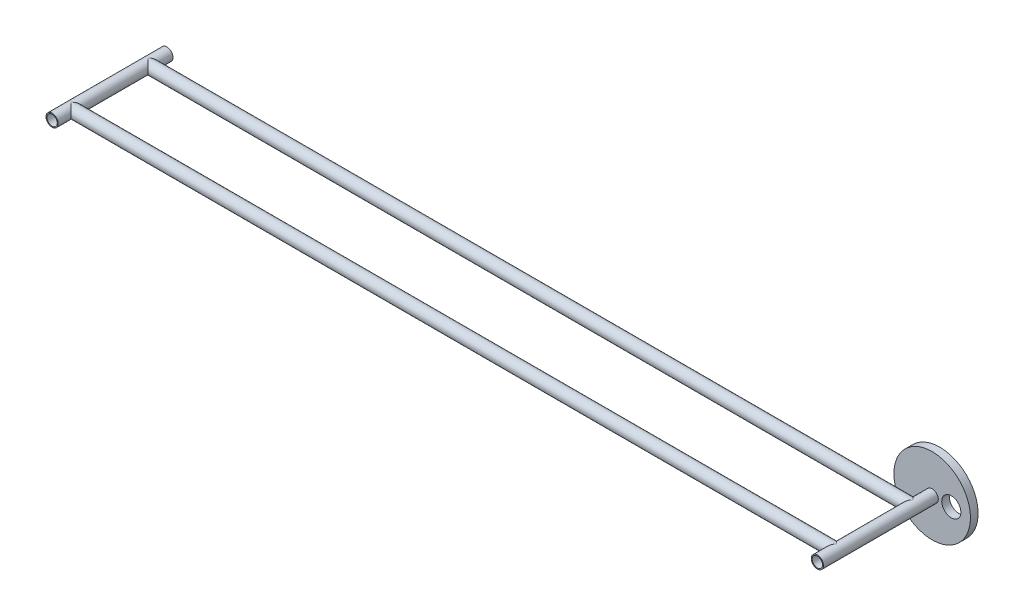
ISO-10303-21;
HEADER;
FILE_DESCRIPTION(('STEP AP214'),'2;1');
FILE_NAME('part.step','',(''),(''),'','','');
FILE_SCHEMA(('AUTOMOTIVE_DESIGN { 1 0 10303 214 1 1 1 1 }'));
ENDSEC;
DATA;
#1=APPLICATION_CONTEXT('core data for automotive mechanical design processes');
#2=APPLICATION_PROTOCOL_DEFINITION('international standard','automotive_design',2000,#1);
#3=PRODUCT_CONTEXT('',#1,'mechanical');
#4=PRODUCT('Part','Part','',(#3));
#5=PRODUCT_RELATED_PRODUCT_CATEGORY('part','',(#4));
#6=PRODUCT_DEFINITION_FORMATION('','',#4);
#7=PRODUCT_DEFINITION_CONTEXT('part definition',#1,'design');
#8=PRODUCT_DEFINITION('design','',#6,#7);
#9=PRODUCT_DEFINITION_SHAPE('','',#8);
#10=(LENGTH_UNIT() NAMED_UNIT(*) SI_UNIT(.MILLI.,.METRE.));
#11=(NAMED_UNIT(*) PLANE_ANGLE_UNIT() SI_UNIT($,.RADIAN.));
#12=(NAMED_UNIT(*) SI_UNIT($,.STERADIAN.) SOLID_ANGLE_UNIT());
#13=UNCERTAINTY_MEASURE_WITH_UNIT(LENGTH_MEASURE(1.E-05),#10,'distance_accuracy_value','');
#14=(GEOMETRIC_REPRESENTATION_CONTEXT(3) GLOBAL_UNCERTAINTY_ASSIGNED_CONTEXT((#13)) GLOBAL_UNIT_ASSIGNED_CONTEXT((#10,
#11,#12)) REPRESENTATION_CONTEXT('',''));
#15=CARTESIAN_POINT('',(0.,0.,0.));
#16=DIRECTION('',(0.,0.,1.));
#17=DIRECTION('',(1.,0.,0.));
#18=AXIS2_PLACEMENT_3D('',#15,#16,#17);
#19=CARTESIAN_POINT('',(0.,0.,-75.));
#20=DIRECTION('',(0.,0.,1.));
#21=DIRECTION('',(1.,0.,0.));
#22=AXIS2_PLACEMENT_3D('',#19,#20,#21);
#23=CYLINDRICAL_SURFACE('',#22,8.);
#24=CARTESIAN_POINT('',(0.,0.,75.));
#25=DIRECTION('',(0.,0.,1.));
#26=DIRECTION('',(1.,0.,0.));
#27=AXIS2_PLACEMENT_3D('',#24,#25,#26);
#28=CIRCLE('',#27,8.);
#29=CARTESIAN_POINT('',(8.,0.,75.));
#30=VERTEX_POINT('',#29);
#31=EDGE_CURVE('E170',#30,#30,#28,.T.);
#32=ORIENTED_EDGE('',*,*,#31,.F.);
#33=EDGE_LOOP('',(#32));
#34=FACE_BOUND('',#33,.T.);
#35=CARTESIAN_POINT('',(0.,0.,-75.));
#36=DIRECTION('',(0.,0.,1.));
#37=DIRECTION('',(1.,0.,0.));
#38=AXIS2_PLACEMENT_3D('',#35,#36,#37);
#39=CIRCLE('',#38,8.);
#40=CARTESIAN_POINT('',(8.,0.,-75.));
#41=VERTEX_POINT('',#40);
#42=EDGE_CURVE('E162',#41,#41,#39,.T.);
#43=ORIENTED_EDGE('',*,*,#42,.T.);
#44=EDGE_LOOP('',(#43));
#45=FACE_BOUND('',#44,.T.);
#46=CARTESIAN_POINT('',(0.,0.,50.));
#47=DIRECTION('',(-0.707106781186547,0.,0.707106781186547));
#48=DIRECTION('',(-0.707106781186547,0.,-0.707106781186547));
#49=AXIS2_PLACEMENT_3D('',#46,#47,#48);
#50=ELLIPSE('',#49,11.3137084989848,8.);
#51=CARTESIAN_POINT('',(0.,8.,50.));
#52=VERTEX_POINT('',#51);
#53=CARTESIAN_POINT('',(0.,-8.,50.));
#54=VERTEX_POINT('',#53);
#55=EDGE_CURVE('E154',#52,#54,#50,.F.);
#56=ORIENTED_EDGE('',*,*,#55,.F.);
#57=CARTESIAN_POINT('',(0.,0.,50.));
#58=DIRECTION('',(-0.707106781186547,0.,-0.707106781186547));
#59=DIRECTION('',(-0.707106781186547,0.,0.707106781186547));
#60=AXIS2_PLACEMENT_3D('',#57,#58,#59);
#61=ELLIPSE('',#60,11.3137084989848,8.);
#62=EDGE_CURVE('E158',#54,#52,#61,.F.);
#63=ORIENTED_EDGE('',*,*,#62,.F.);
#64=EDGE_LOOP('',(#56,#63));
#65=FACE_BOUND('',#64,.T.);
#66=CARTESIAN_POINT('',(0.,0.,-50.));
#67=DIRECTION('',(0.707106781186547,0.,0.707106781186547));
#68=DIRECTION('',(-0.707106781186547,0.,0.707106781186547));
#69=AXIS2_PLACEMENT_3D('',#66,#67,#68);
#70=ELLIPSE('',#69,11.3137084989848,8.);
#71=CARTESIAN_POINT('',(0.,8.,-50.));
#72=VERTEX_POINT('',#71);
#73=CARTESIAN_POINT('',(0.,-8.,-50.));
#74=VERTEX_POINT('',#73);
#75=EDGE_CURVE('E136',#72,#74,#70,.F.);
#76=ORIENTED_EDGE('',*,*,#75,.T.);
#77=CARTESIAN_POINT('',(0.,0.,-50.));
#78=DIRECTION('',(-0.707106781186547,0.,0.707106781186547));
#79=DIRECTION('',(0.707106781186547,0.,0.707106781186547));
#80=AXIS2_PLACEMENT_3D('',#77,#78,#79);
#81=ELLIPSE('',#80,11.3137084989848,8.);
#82=EDGE_CURVE('E177',#74,#72,#81,.T.);
#83=ORIENTED_EDGE('',*,*,#82,.T.);
#84=EDGE_LOOP('',(#76,#83));
#85=FACE_BOUND('',#84,.T.);
#86=ADVANCED_FACE('F42',(#34,#45,#65,#85),#23,.T.);
#87=CARTESIAN_POINT('',(1000.,0.,50.));
#88=DIRECTION('',(-1.,0.,0.));
#89=DIRECTION('',(0.,0.,1.));
#90=AXIS2_PLACEMENT_3D('',#87,#88,#89);
#91=CYLINDRICAL_SURFACE('',#90,8.);
#92=CARTESIAN_POINT('',(1000.,0.,50.));
#93=DIRECTION('',(-0.707106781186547,0.,-0.707106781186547));
#94=DIRECTION('',(-0.707106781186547,0.,0.707106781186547));
#95=AXIS2_PLACEMENT_3D('',#92,#93,#94);
#96=ELLIPSE('',#95,11.3137084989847,7.99999999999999);
#97=CARTESIAN_POINT('',(1000.,-7.99999999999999,50.));
#98=VERTEX_POINT('',#97);
#99=CARTESIAN_POINT('',(1000.,7.99999999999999,50.));
#100=VERTEX_POINT('',#99);
#101=EDGE_CURVE('E97',#98,#100,#96,.T.);
#102=ORIENTED_EDGE('',*,*,#101,.T.);
#103=CARTESIAN_POINT('',(1000.,0.,50.));
#104=DIRECTION('',(-0.707106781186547,0.,0.707106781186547));
#105=DIRECTION('',(-0.707106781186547,0.,-0.707106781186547));
#106=AXIS2_PLACEMENT_3D('',#103,#104,#105);
#107=ELLIPSE('',#106,11.3137084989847,7.99999999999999);
#108=EDGE_CURVE('E64',#100,#98,#107,.T.);
#109=ORIENTED_EDGE('',*,*,#108,.T.);
#110=EDGE_LOOP('',(#102,#109));
#111=FACE_BOUND('',#110,.T.);
#112=ORIENTED_EDGE('',*,*,#62,.T.);
#113=ORIENTED_EDGE('',*,*,#55,.T.);
#114=EDGE_LOOP('',(#112,#113));
#115=FACE_BOUND('',#114,.T.);
#116=ADVANCED_FACE('F44',(#111,#115),#91,.T.);
#117=CARTESIAN_POINT('',(0.,0.,-75.));
#118=DIRECTION('',(0.,0.,1.));
#119=DIRECTION('',(1.,0.,0.));
#120=AXIS2_PLACEMENT_3D('',#117,#118,#119);
#121=PLANE('',#120);
#122=CARTESIAN_POINT('',(0.,0.,-75.));
#123=DIRECTION('',(0.,0.,1.));
#124=DIRECTION('',(1.,0.,0.));
#125=AXIS2_PLACEMENT_3D('',#122,#123,#124);
#126=CIRCLE('',#125,6.75);
#127=CARTESIAN_POINT('',(6.75,0.,-75.));
#128=VERTEX_POINT('',#127);
#129=EDGE_CURVE('E166',#128,#128,#126,.T.);
#130=ORIENTED_EDGE('',*,*,#129,.T.);
#131=EDGE_LOOP('',(#130));
#132=FACE_BOUND('',#131,.T.);
#133=ORIENTED_EDGE('',*,*,#42,.F.);
#134=EDGE_LOOP('',(#133));
#135=FACE_BOUND('',#134,.T.);
#136=ADVANCED_FACE('F145',(#132,#135),#121,.F.);
#137=CARTESIAN_POINT('',(0.,0.,75.));
#138=DIRECTION('',(0.,0.,1.));
#139=DIRECTION('',(1.,0.,0.));
#140=AXIS2_PLACEMENT_3D('',#137,#138,#139);
#141=PLANE('',#140);
#142=ORIENTED_EDGE('',*,*,#31,.T.);
#143=EDGE_LOOP('',(#142));
#144=FACE_BOUND('',#143,.T.);
#145=CARTESIAN_POINT('',(0.,0.,75.));
#146=DIRECTION('',(0.,0.,1.));
#147=DIRECTION('',(1.,0.,0.));
#148=AXIS2_PLACEMENT_3D('',#145,#146,#147);
#149=CIRCLE('',#148,6.75);
#150=CARTESIAN_POINT('',(6.75,0.,75.));
#151=VERTEX_POINT('',#150);
#152=EDGE_CURVE('E174',#151,#151,#149,.T.);
#153=ORIENTED_EDGE('',*,*,#152,.F.);
#154=EDGE_LOOP('',(#153));
#155=FACE_BOUND('',#154,.T.);
#156=ADVANCED_FACE('F340',(#144,#155),#141,.T.);
#157=CARTESIAN_POINT('',(1000.,0.,-50.));
#158=DIRECTION('',(-1.,0.,0.));
#159=DIRECTION('',(0.,0.,1.));
#160=AXIS2_PLACEMENT_3D('',#157,#158,#159);
#161=CYLINDRICAL_SURFACE('',#160,8.);
#162=ORIENTED_EDGE('',*,*,#82,.F.);
#163=ORIENTED_EDGE('',*,*,#75,.F.);
#164=EDGE_LOOP('',(#162,#163));
#165=FACE_BOUND('',#164,.T.);
#166=CARTESIAN_POINT('',(1000.,0.,-50.));
#167=DIRECTION('',(-0.707106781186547,0.,-0.707106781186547));
#168=DIRECTION('',(-0.707106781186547,0.,0.707106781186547));
#169=AXIS2_PLACEMENT_3D('',#166,#167,#168);
#170=ELLIPSE('',#169,11.3137084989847,7.99999999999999);
#171=CARTESIAN_POINT('',(1000.,-7.99999999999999,-50.));
#172=VERTEX_POINT('',#171);
#173=CARTESIAN_POINT('',(1000.,7.99999999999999,-50.));
#174=VERTEX_POINT('',#173);
#175=EDGE_CURVE('E88',#172,#174,#170,.T.);
#176=ORIENTED_EDGE('',*,*,#175,.T.);
#177=CARTESIAN_POINT('',(1000.,0.,-50.));
#178=DIRECTION('',(-0.707106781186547,0.,0.707106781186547));
#179=DIRECTION('',(-0.707106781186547,0.,-0.707106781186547));
#180=AXIS2_PLACEMENT_3D('',#177,#178,#179);
#181=ELLIPSE('',#180,11.3137084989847,7.99999999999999);
#182=EDGE_CURVE('E71',#174,#172,#181,.T.);
#183=ORIENTED_EDGE('',*,*,#182,.T.);
#184=EDGE_LOOP('',(#176,#183));
#185=FACE_BOUND('',#184,.T.);
#186=ADVANCED_FACE('F95',(#165,#185),#161,.T.);
#187=CARTESIAN_POINT('',(0.,0.,-75.));
#188=DIRECTION('',(0.,0.,1.));
#189=DIRECTION('',(1.,0.,0.));
#190=AXIS2_PLACEMENT_3D('',#187,#188,#189);
#191=CYLINDRICAL_SURFACE('',#190,6.75);
#192=ORIENTED_EDGE('',*,*,#152,.T.);
#193=EDGE_LOOP('',(#192));
#194=FACE_BOUND('',#193,.T.);
#195=ORIENTED_EDGE('',*,*,#129,.F.);
#196=EDGE_LOOP('',(#195));
#197=FACE_BOUND('',#196,.T.);
#198=ADVANCED_FACE('F287',(#194,#197),#191,.F.);
#199=CARTESIAN_POINT('',(1000.,0.,75.));
#200=DIRECTION('',(0.,0.,1.));
#201=DIRECTION('',(1.,0.,0.));
#202=AXIS2_PLACEMENT_3D('',#199,#200,#201);
#203=PLANE('',#202);
#204=CARTESIAN_POINT('',(1000.,0.,75.));
#205=DIRECTION('',(0.,0.,1.));
#206=DIRECTION('',(1.,0.,0.));
#207=AXIS2_PLACEMENT_3D('',#204,#205,#206);
#208=CIRCLE('',#207,7.99999999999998);
#209=CARTESIAN_POINT('',(1008.,0.,75.));
#210=VERTEX_POINT('',#209);
#211=EDGE_CURVE('E93',#210,#210,#208,.T.);
#212=ORIENTED_EDGE('',*,*,#211,.T.);
#213=EDGE_LOOP('',(#212));
#214=FACE_BOUND('',#213,.T.);
#215=CARTESIAN_POINT('',(1000.,0.,75.));
#216=DIRECTION('',(0.,0.,1.));
#217=DIRECTION('',(1.,0.,0.));
#218=AXIS2_PLACEMENT_3D('',#215,#216,#217);
#219=CIRCLE('',#218,6.75000000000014);
#220=CARTESIAN_POINT('',(1006.75,0.,75.));
#221=VERTEX_POINT('',#220);
#222=EDGE_CURVE('E298',#221,#221,#219,.T.);
#223=ORIENTED_EDGE('',*,*,#222,.F.);
#224=EDGE_LOOP('',(#223));
#225=FACE_BOUND('',#224,.T.);
#226=ADVANCED_FACE('F195',(#214,#225),#203,.T.);
#227=CARTESIAN_POINT('',(1000.,0.,-75.));
#228=DIRECTION('',(0.,0.,1.));
#229=DIRECTION('',(1.,0.,0.));
#230=AXIS2_PLACEMENT_3D('',#227,#228,#229);
#231=CYLINDRICAL_SURFACE('',#230,6.75000000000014);
#232=ORIENTED_EDGE('',*,*,#222,.T.);
#233=EDGE_LOOP('',(#232));
#234=FACE_BOUND('',#233,.T.);
#235=CARTESIAN_POINT('',(1000.,0.,-85.));
#236=DIRECTION('',(0.,0.,-1.));
#237=DIRECTION('',(-1.,0.,0.));
#238=AXIS2_PLACEMENT_3D('',#235,#236,#237);
#239=CIRCLE('',#238,6.75000000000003);
#240=CARTESIAN_POINT('',(993.25,0.,-85.));
#241=VERTEX_POINT('',#240);
#242=EDGE_CURVE('E312',#241,#241,#239,.T.);
#243=ORIENTED_EDGE('',*,*,#242,.T.);
#244=EDGE_LOOP('',(#243));
#245=FACE_BOUND('',#244,.T.);
#246=ADVANCED_FACE('F117',(#234,#245),#231,.F.);
#247=CARTESIAN_POINT('',(1000.,0.,-75.));
#248=DIRECTION('',(0.,0.,1.));
#249=DIRECTION('',(1.,0.,0.));
#250=AXIS2_PLACEMENT_3D('',#247,#248,#249);
#251=CYLINDRICAL_SURFACE('',#250,7.99999999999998);
#252=ORIENTED_EDGE('',*,*,#182,.F.);
#253=ORIENTED_EDGE('',*,*,#175,.F.);
#254=EDGE_LOOP('',(#252,#253));
#255=FACE_BOUND('',#254,.T.);
#256=CARTESIAN_POINT('',(1000.,0.,-75.));
#257=DIRECTION('',(0.,0.,1.));
#258=DIRECTION('',(1.,0.,0.));
#259=AXIS2_PLACEMENT_3D('',#256,#257,#258);
#260=CIRCLE('',#259,7.99999999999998);
#261=CARTESIAN_POINT('',(1008.,0.,-75.));
#262=VERTEX_POINT('',#261);
#263=EDGE_CURVE('E300',#262,#262,#260,.T.);
#264=ORIENTED_EDGE('',*,*,#263,.T.);
#265=EDGE_LOOP('',(#264));
#266=FACE_BOUND('',#265,.T.);
#267=ORIENTED_EDGE('',*,*,#211,.F.);
#268=EDGE_LOOP('',(#267));
#269=FACE_BOUND('',#268,.T.);
#270=ORIENTED_EDGE('',*,*,#108,.F.);
#271=ORIENTED_EDGE('',*,*,#101,.F.);
#272=EDGE_LOOP('',(#270,#271));
#273=FACE_BOUND('',#272,.T.);
#274=ADVANCED_FACE('F89',(#255,#266,#269,#273),#251,.T.);
#275=CARTESIAN_POINT('',(1000.,0.,-85.));
#276=DIRECTION('',(0.,0.,-1.));
#277=DIRECTION('',(-1.,0.,0.));
#278=AXIS2_PLACEMENT_3D('',#275,#276,#277);
#279=PLANE('',#278);
#280=ORIENTED_EDGE('',*,*,#242,.F.);
#281=EDGE_LOOP('',(#280));
#282=FACE_BOUND('',#281,.T.);
#283=CARTESIAN_POINT('',(1000.,0.,-85.));
#284=DIRECTION('',(0.,0.,-1.));
#285=DIRECTION('',(-1.,0.,0.));
#286=AXIS2_PLACEMENT_3D('',#283,#284,#285);
#287=CIRCLE('',#286,50.);
#288=CARTESIAN_POINT('',(950.,0.,-85.));
#289=VERTEX_POINT('',#288);
#290=EDGE_CURVE('E306',#289,#289,#287,.T.);
#291=ORIENTED_EDGE('',*,*,#290,.T.);
#292=EDGE_LOOP('',(#291));
#293=FACE_BOUND('',#292,.T.);
#294=CARTESIAN_POINT('',(1025.,0.,-85.));
#295=DIRECTION('',(0.,0.,-1.));
#296=DIRECTION('',(-1.,0.,0.));
#297=AXIS2_PLACEMENT_3D('',#294,#295,#296);
#298=CIRCLE('',#297,12.5);
#299=CARTESIAN_POINT('',(1012.5,0.,-85.));
#300=VERTEX_POINT('',#299);
#301=EDGE_CURVE('E319',#300,#300,#298,.T.);
#302=ORIENTED_EDGE('',*,*,#301,.F.);
#303=EDGE_LOOP('',(#302));
#304=FACE_BOUND('',#303,.T.);
#305=ADVANCED_FACE('F187',(#282,#293,#304),#279,.T.);
#306=CARTESIAN_POINT('',(1000.,0.,-75.));
#307=DIRECTION('',(0.,0.,-1.));
#308=DIRECTION('',(-1.,0.,0.));
#309=AXIS2_PLACEMENT_3D('',#306,#307,#308);
#310=PLANE('',#309);
#311=ORIENTED_EDGE('',*,*,#263,.F.);
#312=EDGE_LOOP('',(#311));
#313=FACE_BOUND('',#312,.T.);
#314=CARTESIAN_POINT('',(1000.,0.,-75.));
#315=DIRECTION('',(0.,0.,-1.));
#316=DIRECTION('',(-1.,0.,0.));
#317=AXIS2_PLACEMENT_3D('',#314,#315,#316);
#318=CIRCLE('',#317,50.);
#319=CARTESIAN_POINT('',(950.,0.,-75.));
#320=VERTEX_POINT('',#319);
#321=EDGE_CURVE('E308',#320,#320,#318,.T.);
#322=ORIENTED_EDGE('',*,*,#321,.F.);
#323=EDGE_LOOP('',(#322));
#324=FACE_BOUND('',#323,.T.);
#325=CARTESIAN_POINT('',(1025.,0.,-75.));
#326=DIRECTION('',(0.,0.,-1.));
#327=DIRECTION('',(-1.,0.,0.));
#328=AXIS2_PLACEMENT_3D('',#325,#326,#327);
#329=CIRCLE('',#328,12.5);
#330=CARTESIAN_POINT('',(1012.5,0.,-75.));
#331=VERTEX_POINT('',#330);
#332=EDGE_CURVE('E320',#331,#331,#329,.T.);
#333=ORIENTED_EDGE('',*,*,#332,.T.);
#334=EDGE_LOOP('',(#333));
#335=FACE_BOUND('',#334,.T.);
#336=ADVANCED_FACE('F192',(#313,#324,#335),#310,.F.);
#337=CARTESIAN_POINT('',(1000.,0.,-85.));
#338=DIRECTION('',(0.,0.,1.));
#339=DIRECTION('',(1.,0.,0.));
#340=AXIS2_PLACEMENT_3D('',#337,#338,#339);
#341=CYLINDRICAL_SURFACE('',#340,50.);
#342=ORIENTED_EDGE('',*,*,#290,.F.);
#343=EDGE_LOOP('',(#342));
#344=FACE_BOUND('',#343,.T.);
#345=ORIENTED_EDGE('',*,*,#321,.T.);
#346=EDGE_LOOP('',(#345));
#347=FACE_BOUND('',#346,.T.);
#348=ADVANCED_FACE('F262',(#344,#347),#341,.T.);
#349=CARTESIAN_POINT('',(1025.,0.,-85.));
#350=DIRECTION('',(0.,0.,1.));
#351=DIRECTION('',(1.,0.,0.));
#352=AXIS2_PLACEMENT_3D('',#349,#350,#351);
#353=CYLINDRICAL_SURFACE('',#352,12.5);
#354=ORIENTED_EDGE('',*,*,#301,.T.);
#355=EDGE_LOOP('',(#354));
#356=FACE_BOUND('',#355,.T.);
#357=ORIENTED_EDGE('',*,*,#332,.F.);
#358=EDGE_LOOP('',(#357));
#359=FACE_BOUND('',#358,.T.);
#360=ADVANCED_FACE('F272',(#356,#359),#353,.F.);
#361=CLOSED_SHELL('',(#86,#116,#136,#156,#186,#198,#226,#246,#274,#305,#336,#348,#360));
#362=CARTESIAN_POINT('',(992.,0.,-43.25));
#363=CARTESIAN_POINT('',(992.000001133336,0.159591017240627,-43.2500011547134));
#364=CARTESIAN_POINT('',(992.004786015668,0.319202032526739,-43.2556702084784));
#365=CARTESIAN_POINT('',(992.023819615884,0.637125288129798,-43.2782450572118));
#366=CARTESIAN_POINT('',(992.038073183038,0.79543682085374,-43.2951566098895));
#367=CARTESIAN_POINT('',(992.075748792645,1.1096479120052,-43.3399396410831));
#368=CARTESIAN_POINT('',(992.099185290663,1.2655432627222,-43.3678283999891));
#369=CARTESIAN_POINT('',(992.154723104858,1.57357617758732,-43.4340883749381));
#370=CARTESIAN_POINT('',(992.186828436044,1.72571196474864,-43.4724644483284));
#371=CARTESIAN_POINT('',(992.258790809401,2.02412011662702,-43.5587745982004));
#372=CARTESIAN_POINT('',(992.298590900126,2.17042657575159,-43.6066385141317));
#373=CARTESIAN_POINT('',(992.385356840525,2.45759062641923,-43.7114272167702));
#374=CARTESIAN_POINT('',(992.432325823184,2.59844580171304,-43.7683559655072));
#375=CARTESIAN_POINT('',(992.582800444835,3.01179790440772,-43.9516723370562));
#376=CARTESIAN_POINT('',(992.695946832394,3.27537479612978,-44.0906768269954));
#377=CARTESIAN_POINT('',(992.90289261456,3.69700063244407,-44.3488618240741));
#378=CARTESIAN_POINT('',(992.991669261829,3.86226494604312,-44.460637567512));
#379=CARTESIAN_POINT('',(993.176308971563,4.17982270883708,-44.6961698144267));
#380=CARTESIAN_POINT('',(993.272171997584,4.33211622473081,-44.8199262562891));
#381=CARTESIAN_POINT('',(993.469285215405,4.62394560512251,-45.0786403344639));
#382=CARTESIAN_POINT('',(993.570549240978,4.76344594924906,-45.2136272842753));
#383=CARTESIAN_POINT('',(993.776258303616,5.02924115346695,-45.4937261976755));
#384=CARTESIAN_POINT('',(993.880702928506,5.15553771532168,-45.6388368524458));
#385=CARTESIAN_POINT('',(994.092733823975,5.39727165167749,-45.9416484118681));
#386=CARTESIAN_POINT('',(994.200341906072,5.51245387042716,-46.0995376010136));
#387=CARTESIAN_POINT('',(994.41427567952,5.72912374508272,-46.4253749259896));
#388=CARTESIAN_POINT('',(994.520600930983,5.83060681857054,-46.5933264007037));
#389=CARTESIAN_POINT('',(994.728650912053,6.01934736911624,-46.9391713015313));
#390=CARTESIAN_POINT('',(994.830385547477,6.10663665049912,-47.117041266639));
#391=CARTESIAN_POINT('',(995.02543931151,6.26654849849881,-47.4834875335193));
#392=CARTESIAN_POINT('',(995.118765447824,6.33918334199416,-47.6720547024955));
#393=CARTESIAN_POINT('',(995.298427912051,6.47369623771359,-48.0758454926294));
#394=CARTESIAN_POINT('',(995.383674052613,6.53431676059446,-48.2920037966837));
#395=CARTESIAN_POINT('',(995.4927550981,6.60959287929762,-48.6256782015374));
#396=CARTESIAN_POINT('',(995.525969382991,6.63206676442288,-48.7384034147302));
#397=CARTESIAN_POINT('',(995.584911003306,6.6714497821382,-48.9667224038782));
#398=CARTESIAN_POINT('',(995.610642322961,6.68836187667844,-49.0823146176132));
#399=CARTESIAN_POINT('',(995.653757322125,6.71646138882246,-49.3174617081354));
#400=CARTESIAN_POINT('',(995.671018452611,6.727564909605,-49.4370494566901));
#401=CARTESIAN_POINT('',(995.695689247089,6.74337656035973,-49.6776619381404));
#402=CARTESIAN_POINT('',(995.703100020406,6.748085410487,-49.7986865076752));
#403=CARTESIAN_POINT('',(995.70762110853,6.75096227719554,-50.0409653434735));
#404=CARTESIAN_POINT('',(995.704735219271,6.74913270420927,-50.1622195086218));
#405=CARTESIAN_POINT('',(995.688850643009,6.73899673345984,-50.403787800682));
#406=CARTESIAN_POINT('',(995.675850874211,6.7306896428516,-50.5241018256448));
#407=CARTESIAN_POINT('',(995.63954797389,6.70723071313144,-50.7690870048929));
#408=CARTESIAN_POINT('',(995.615732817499,6.69173779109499,-50.893648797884));
#409=CARTESIAN_POINT('',(995.559041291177,6.65424992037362,-51.1397257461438));
#410=CARTESIAN_POINT('',(995.526158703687,6.63225050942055,-51.2612387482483));
#411=CARTESIAN_POINT('',(995.416030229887,6.55706259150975,-51.6209650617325));
#412=CARTESIAN_POINT('',(995.327393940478,6.49473849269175,-51.8538339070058));
#413=CARTESIAN_POINT('',(995.150159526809,6.3630819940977,-52.2605894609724));
#414=CARTESIAN_POINT('',(995.064835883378,6.29740573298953,-52.4372034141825));
#415=CARTESIAN_POINT('',(994.886250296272,6.15327019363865,-52.7810979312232));
#416=CARTESIAN_POINT('',(994.792983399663,6.07480291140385,-52.9483725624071));
#417=CARTESIAN_POINT('',(994.601839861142,5.90560719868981,-53.2741489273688));
#418=CARTESIAN_POINT('',(994.503956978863,5.81486184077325,-53.4326381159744));
#419=CARTESIAN_POINT('',(994.306330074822,5.62149790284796,-53.7409018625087));
#420=CARTESIAN_POINT('',(994.206586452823,5.51888184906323,-53.890678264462));
#421=CARTESIAN_POINT('',(994.001053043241,5.29501293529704,-54.1907702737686));
#422=CARTESIAN_POINT('',(993.895278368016,5.17299311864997,-54.3405249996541));
#423=CARTESIAN_POINT('',(993.686175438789,4.91559996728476,-54.6299983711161));
#424=CARTESIAN_POINT('',(993.582847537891,4.78022471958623,-54.7697155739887));
#425=CARTESIAN_POINT('',(993.380864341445,4.4963690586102,-55.0381796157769));
#426=CARTESIAN_POINT('',(993.282200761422,4.34791333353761,-55.1669462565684));
#427=CARTESIAN_POINT('',(993.091305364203,4.03770916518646,-55.4128143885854));
#428=CARTESIAN_POINT('',(992.99907377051,3.8759602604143,-55.5299154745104));
#429=CARTESIAN_POINT('',(992.84217025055,3.57597372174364,-55.7271083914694));
#430=CARTESIAN_POINT('',(992.775859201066,3.44024410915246,-55.809719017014));
#431=CARTESIAN_POINT('',(992.649426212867,3.16109626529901,-55.9662015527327));
#432=CARTESIAN_POINT('',(992.589302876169,3.01767978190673,-56.0400754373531));
#433=CARTESIAN_POINT('',(992.476240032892,2.72357368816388,-56.1782717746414));
#434=CARTESIAN_POINT('',(992.423300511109,2.57288409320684,-56.2425942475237));
#435=CARTESIAN_POINT('',(992.325622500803,2.26495124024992,-56.3607921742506));
#436=CARTESIAN_POINT('',(992.280880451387,2.10771086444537,-56.414672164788));
#437=CARTESIAN_POINT('',(992.200152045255,1.78608544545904,-56.5115938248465));
#438=CARTESIAN_POINT('',(992.164247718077,1.62164901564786,-56.5545340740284));
#439=CARTESIAN_POINT('',(992.10257242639,1.28817084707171,-56.6281419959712));
#440=CARTESIAN_POINT('',(992.076801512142,1.11912908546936,-56.6588096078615));
#441=CARTESIAN_POINT('',(992.036072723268,0.778035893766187,-56.7072206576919));
#442=CARTESIAN_POINT('',(992.021106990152,0.605986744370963,-56.7249734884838));
#443=CARTESIAN_POINT('',(992.002369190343,0.260435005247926,-56.7471946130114));
#444=CARTESIAN_POINT('',(991.998595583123,0.0869326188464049,-56.7516647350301));
#445=CARTESIAN_POINT('',(992.002085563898,-0.236386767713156,-56.747527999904));
#446=CARTESIAN_POINT('',(992.007930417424,-0.386245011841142,-56.7406020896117));
#447=CARTESIAN_POINT('',(992.027948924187,-0.684666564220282,-56.7168548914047));
#448=CARTESIAN_POINT('',(992.042125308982,-0.833229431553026,-56.7000303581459));
#449=CARTESIAN_POINT('',(992.078515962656,-1.12788412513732,-56.6567669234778));
#450=CARTESIAN_POINT('',(992.10072725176,-1.27397684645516,-56.630331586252));
#451=CARTESIAN_POINT('',(992.152768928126,-1.56285544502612,-56.5682434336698));
#452=CARTESIAN_POINT('',(992.182602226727,-1.7056400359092,-56.5325870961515));
#453=CARTESIAN_POINT('',(992.249123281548,-1.98608454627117,-56.4528343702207));
#454=CARTESIAN_POINT('',(992.285762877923,-2.12377278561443,-56.4087972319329));
#455=CARTESIAN_POINT('',(992.365430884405,-2.3944289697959,-56.3126748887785));
#456=CARTESIAN_POINT('',(992.408461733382,-2.52739508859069,-56.260586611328));
#457=CARTESIAN_POINT('',(992.546203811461,-2.91841454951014,-56.0930822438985));
#458=CARTESIAN_POINT('',(992.649599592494,-3.1687325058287,-55.9663850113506));
#459=CARTESIAN_POINT('',(992.842672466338,-3.57894482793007,-55.7265495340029));
#460=CARTESIAN_POINT('',(992.928107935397,-3.74455915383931,-55.6195174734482));
#461=CARTESIAN_POINT('',(993.106336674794,-4.06333829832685,-55.3935083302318));
#462=CARTESIAN_POINT('',(993.199132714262,-4.21649838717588,-55.2745267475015));
#463=CARTESIAN_POINT('',(993.390397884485,-4.51043181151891,-55.0255067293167));
#464=CARTESIAN_POINT('',(993.488879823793,-4.65117521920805,-54.8954429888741));
#465=CARTESIAN_POINT('',(993.689450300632,-4.91986347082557,-54.6253352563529));
#466=CARTESIAN_POINT('',(993.791538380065,-5.04780993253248,-54.4852925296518));
#467=CARTESIAN_POINT('',(993.999295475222,-5.29318955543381,-54.1930565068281));
#468=CARTESIAN_POINT('',(994.10499582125,-5.41038630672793,-54.040687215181));
#469=CARTESIAN_POINT('',(994.315916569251,-5.63156687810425,-53.7262471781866));
#470=CARTESIAN_POINT('',(994.421136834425,-5.73554713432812,-53.5641738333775));
#471=CARTESIAN_POINT('',(994.62819239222,-5.92990655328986,-53.2304704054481));
#472=CARTESIAN_POINT('',(994.730033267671,-6.02030911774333,-53.0588574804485));
#473=CARTESIAN_POINT('',(994.927000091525,-6.18719026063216,-52.7054255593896));
#474=CARTESIAN_POINT('',(995.022130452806,-6.26367804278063,-52.5236134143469));
#475=CARTESIAN_POINT('',(995.213343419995,-6.41126770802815,-52.1235904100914));
#476=CARTESIAN_POINT('',(995.307803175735,-6.4802299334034,-51.9037883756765));
#477=CARTESIAN_POINT('',(995.472801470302,-6.59657200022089,-51.4499040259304));
#478=CARTESIAN_POINT('',(995.543393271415,-6.64399997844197,-51.2158549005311));
#479=CARTESIAN_POINT('',(995.619200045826,-6.69397616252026,-50.874014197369));
#480=CARTESIAN_POINT('',(995.638693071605,-6.70666511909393,-50.7707727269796));
#481=CARTESIAN_POINT('',(995.670605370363,-6.72731070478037,-50.5627540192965));
#482=CARTESIAN_POINT('',(995.683027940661,-6.73526953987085,-50.4579775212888));
#483=CARTESIAN_POINT('',(995.700252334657,-6.74627863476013,-50.2476135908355));
#484=CARTESIAN_POINT('',(995.705059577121,-6.7493323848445,-50.1420267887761));
#485=CARTESIAN_POINT('',(995.70684997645,-6.75047140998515,-49.9307571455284));
#486=CARTESIAN_POINT('',(995.70383299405,-6.74855659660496,-49.8250743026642));
#487=CARTESIAN_POINT('',(995.690126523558,-6.73981125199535,-49.6146286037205));
#488=CARTESIAN_POINT('',(995.679452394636,-6.73299056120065,-49.5098643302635));
#489=CARTESIAN_POINT('',(995.650926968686,-6.71459948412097,-49.3017241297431));
#490=CARTESIAN_POINT('',(995.633072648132,-6.70302709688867,-49.1983488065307));
#491=CARTESIAN_POINT('',(995.569721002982,-6.66147141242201,-48.8909388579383));
#492=CARTESIAN_POINT('',(995.514446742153,-6.62465648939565,-48.6897744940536));
#493=CARTESIAN_POINT('',(995.397037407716,-6.54345346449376,-48.3349485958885));
#494=CARTESIAN_POINT('',(995.338174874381,-6.50181283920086,-48.1794962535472));
#495=CARTESIAN_POINT('',(995.211190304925,-6.40886109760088,-47.8753169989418));
#496=CARTESIAN_POINT('',(995.143062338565,-6.35754377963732,-47.726594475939));
#497=CARTESIAN_POINT('',(995.000123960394,-6.24575831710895,-47.4353504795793));
#498=CARTESIAN_POINT('',(994.925292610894,-6.18526106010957,-47.2928506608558));
#499=CARTESIAN_POINT('',(994.77135799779,-6.05569443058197,-47.0142582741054));
#500=CARTESIAN_POINT('',(994.692255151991,-5.9866258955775,-46.8781650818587));
#501=CARTESIAN_POINT('',(994.497943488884,-5.80957003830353,-46.5564861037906));
#502=CARTESIAN_POINT('',(994.381455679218,-5.69737766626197,-46.3739743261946));
#503=CARTESIAN_POINT('',(994.147312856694,-5.45658345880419,-46.0208201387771));
#504=CARTESIAN_POINT('',(994.02965738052,-5.32797484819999,-45.8501826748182));
#505=CARTESIAN_POINT('',(993.796521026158,-5.0546099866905,-45.5212640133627));
#506=CARTESIAN_POINT('',(993.681037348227,-4.90987646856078,-45.3629659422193));
#507=CARTESIAN_POINT('',(993.454904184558,-4.60411321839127,-45.0592472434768));
#508=CARTESIAN_POINT('',(993.344252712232,-4.44309027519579,-44.9138212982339));
#509=CARTESIAN_POINT('',(993.155823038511,-4.14494170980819,-44.6699221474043));
#510=CARTESIAN_POINT('',(993.076475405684,-4.0112139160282,-44.5684967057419));
#511=CARTESIAN_POINT('',(992.923342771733,-3.73442414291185,-44.3746008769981));
#512=CARTESIAN_POINT('',(992.849556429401,-3.59136442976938,-44.2821283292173));
#513=CARTESIAN_POINT('',(992.708817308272,-3.29626440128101,-44.1070762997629));
#514=CARTESIAN_POINT('',(992.641859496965,-3.14423083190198,-44.0244895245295));
#515=CARTESIAN_POINT('',(992.51597942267,-2.83157492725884,-43.8701502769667));
#516=CARTESIAN_POINT('',(992.457055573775,-2.67095429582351,-43.798395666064));
#517=CARTESIAN_POINT('',(992.357395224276,-2.36887702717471,-43.6775896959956));
#518=CARTESIAN_POINT('',(992.315260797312,-2.2285970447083,-43.6267449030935));
#519=CARTESIAN_POINT('',(992.238181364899,-1.94319525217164,-43.5340125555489));
#520=CARTESIAN_POINT('',(992.203234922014,-1.79807441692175,-43.4921232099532));
#521=CARTESIAN_POINT('',(992.141224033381,-1.50405136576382,-43.417958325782));
#522=CARTESIAN_POINT('',(992.114144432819,-1.35515702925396,-43.3856642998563));
#523=CARTESIAN_POINT('',(992.06832230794,-1.054332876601,-43.3310997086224));
#524=CARTESIAN_POINT('',(992.049575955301,-0.902404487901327,-43.3088245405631));
#525=CARTESIAN_POINT('',(992.023514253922,-0.625463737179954,-43.2778813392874));
#526=CARTESIAN_POINT('',(992.014708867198,-0.500785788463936,-43.2674381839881));
#527=CARTESIAN_POINT('',(992.002950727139,-0.250742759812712,-43.2534963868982));
#528=CARTESIAN_POINT('',(991.999999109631,-0.125377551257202,-43.2499990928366));
#529=CARTESIAN_POINT('',(992.,0.,-43.25));
#530=B_SPLINE_CURVE_WITH_KNOTS('',3,(#362,#363,#364,#365,#366,#367,#368,#369,#370,#371,#372,
#373,#374,#375,#376,#377,#378,#379,#380,#381,#382,#383,#384,#385,#386,#387,#388,#389,#390,#391,
#392,#393,#394,#395,#396,#397,#398,#399,#400,#401,#402,#403,#404,#405,#406,#407,#408,#409,#410,
#411,#412,#413,#414,#415,#416,#417,#418,#419,#420,#421,#422,#423,#424,#425,#426,#427,#428,#429,
#430,#431,#432,#433,#434,#435,#436,#437,#438,#439,#440,#441,#442,#443,#444,#445,#446,#447,#448,
#449,#450,#451,#452,#453,#454,#455,#456,#457,#458,#459,#460,#461,#462,#463,#464,#465,#466,#467,
#468,#469,#470,#471,#472,#473,#474,#475,#476,#477,#478,#479,#480,#481,#482,#483,#484,#485,#486,
#487,#488,#489,#490,#491,#492,#493,#494,#495,#496,#497,#498,#499,#500,#501,#502,#503,#504,#505,
#506,#507,#508,#509,#510,#511,#512,#513,#514,#515,#516,#517,#518,#519,#520,#521,#522,#523,#524,
#525,#526,#527,#528,#529),.UNSPECIFIED.,.T.,.F.,(4,2,2,2,2,2,2,2,2,2,2,2,2,2,2,2,2,2,2,2,2,2,2,
2,2,2,2,2,2,2,2,2,2,2,2,2,2,2,2,2,2,2,2,2,2,2,2,2,2,2,2,2,2,2,2,2,2,2,2,2,2,2,2,2,2,2,2,2,2,2,2,
2,2,2,2,2,2,2,2,2,2,2,2,4),(0.,0.478637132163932,0.957519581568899,1.43715892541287,
1.91702079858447,2.39345835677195,2.87010472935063,3.82246390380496,4.47685460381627,
5.13124193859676,5.78739440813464,6.44346220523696,7.11213073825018,7.78102239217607,
8.4483939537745,9.11520407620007,9.83331615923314,10.1919302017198,10.5503529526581,
10.9138188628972,11.277243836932,11.6405348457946,12.0038647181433,12.3865513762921,
12.7695010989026,13.5370061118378,14.1568272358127,14.7770377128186,15.3981121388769,
16.0190546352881,16.6791296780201,17.3392994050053,17.998248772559,18.6572210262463,
19.1732898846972,19.6892418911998,20.2051928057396,20.720919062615,21.2412655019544,
21.7616145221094,22.2815847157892,22.8014833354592,23.2513260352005,23.7013163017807,
24.1511398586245,24.601135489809,25.0480606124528,25.4951567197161,26.3888929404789,
27.0328563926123,27.6770632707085,28.3227827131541,28.9684204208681,29.6259229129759,
30.2836023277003,30.9401348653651,31.5962315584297,32.3413682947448,33.0848310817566,
33.4020250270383,33.7190709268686,34.0358911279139,34.3527169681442,34.6689090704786,
34.985234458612,35.6183444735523,36.1317648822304,36.6455154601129,37.1609307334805,
37.676295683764,38.406948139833,39.1379031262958,39.8678403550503,40.5974746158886,
41.1539492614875,41.7102892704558,42.2662162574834,42.8220333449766,43.2867047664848,
43.7512831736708,44.2149605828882,44.6784247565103,45.0543776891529,45.4304035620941),.UNSPECIFIED.);
#531=CARTESIAN_POINT('',(992.,0.,-43.25));
#532=VERTEX_POINT('',#531);
#533=EDGE_CURVE('E46',#532,#532,#530,.T.);
#534=ORIENTED_EDGE('',*,*,#533,.T.);
#535=EDGE_LOOP('',(#534));
#536=FACE_BOUND('',#535,.T.);
#537=ADVANCED_FACE('F109',(#536),#251,.T.);
#538=CARTESIAN_POINT('',(8.,0.,-56.75));
#539=CARTESIAN_POINT('',(7.99999886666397,-0.159591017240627,-56.7499988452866));
#540=CARTESIAN_POINT('',(7.99521398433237,-0.31920203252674,-56.7443297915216));
#541=CARTESIAN_POINT('',(7.976180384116,-0.637125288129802,-56.7217549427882));
#542=CARTESIAN_POINT('',(7.96192681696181,-0.795436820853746,-56.7048433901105));
#543=CARTESIAN_POINT('',(7.92425120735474,-1.1096479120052,-56.6600603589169));
#544=CARTESIAN_POINT('',(7.90081470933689,-1.2655432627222,-56.6321716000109));
#545=CARTESIAN_POINT('',(7.84527689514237,-1.57357617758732,-56.5659116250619));
#546=CARTESIAN_POINT('',(7.81317156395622,-1.72571196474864,-56.5275355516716));
#547=CARTESIAN_POINT('',(7.74120919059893,-2.02412011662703,-56.4412254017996));
#548=CARTESIAN_POINT('',(7.7014090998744,-2.17042657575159,-56.3933614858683));
#549=CARTESIAN_POINT('',(7.61464315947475,-2.45759062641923,-56.2885727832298));
#550=CARTESIAN_POINT('',(7.56767417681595,-2.59844580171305,-56.2316440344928));
#551=CARTESIAN_POINT('',(7.41719955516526,-3.01179790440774,-56.0483276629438));
#552=CARTESIAN_POINT('',(7.3040531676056,-3.27537479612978,-55.9093231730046));
#553=CARTESIAN_POINT('',(7.09710738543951,-3.69700063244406,-55.6511381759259));
#554=CARTESIAN_POINT('',(7.00833073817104,-3.86226494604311,-55.539362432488));
#555=CARTESIAN_POINT('',(6.82369102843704,-4.17982270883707,-55.3038301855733));
#556=CARTESIAN_POINT('',(6.72782800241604,-4.33211622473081,-55.180073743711));
#557=CARTESIAN_POINT('',(6.53071478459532,-4.62394560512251,-54.9213596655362));
#558=CARTESIAN_POINT('',(6.42945075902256,-4.76344594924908,-54.7863727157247));
#559=CARTESIAN_POINT('',(6.22374169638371,-5.02924115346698,-54.5062738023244));
#560=CARTESIAN_POINT('',(6.11929707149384,-5.15553771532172,-54.3611631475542));
#561=CARTESIAN_POINT('',(5.90726617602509,-5.39727165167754,-54.0583515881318));
#562=CARTESIAN_POINT('',(5.79965809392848,-5.51245387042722,-53.9004623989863));
#563=CARTESIAN_POINT('',(5.58572432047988,-5.72912374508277,-53.5746250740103));
#564=CARTESIAN_POINT('',(5.47939906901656,-5.83060681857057,-53.4066735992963));
#565=CARTESIAN_POINT('',(5.27134908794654,-6.01934736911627,-53.0608286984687));
#566=CARTESIAN_POINT('',(5.16961445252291,-6.10663665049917,-52.882958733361));
#567=CARTESIAN_POINT('',(4.97456068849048,-6.26654849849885,-52.5165124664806));
#568=CARTESIAN_POINT('',(4.88123455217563,-6.33918334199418,-52.3279452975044));
#569=CARTESIAN_POINT('',(4.70157208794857,-6.4736962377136,-51.9241545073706));
#570=CARTESIAN_POINT('',(4.6163259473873,-6.53431676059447,-51.7079962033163));
#571=CARTESIAN_POINT('',(4.50724490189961,-6.60959287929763,-51.3743217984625));
#572=CARTESIAN_POINT('',(4.47403061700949,-6.63206676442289,-51.2615965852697));
#573=CARTESIAN_POINT('',(4.41508899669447,-6.67144978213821,-51.0332775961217));
#574=CARTESIAN_POINT('',(4.38935767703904,-6.68836187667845,-50.9176853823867));
#575=CARTESIAN_POINT('',(4.34624267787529,-6.71646138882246,-50.6825382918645));
#576=CARTESIAN_POINT('',(4.32898154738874,-6.72756490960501,-50.5629505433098));
#577=CARTESIAN_POINT('',(4.30431075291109,-6.74337656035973,-50.3223380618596));
#578=CARTESIAN_POINT('',(4.29689997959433,-6.748085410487,-50.2013134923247));
#579=CARTESIAN_POINT('',(4.29237889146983,-6.75096227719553,-49.9590346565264));
#580=CARTESIAN_POINT('',(4.2952647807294,-6.74913270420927,-49.8377804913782));
#581=CARTESIAN_POINT('',(4.31114935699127,-6.73899673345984,-49.5962121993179));
#582=CARTESIAN_POINT('',(4.32414912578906,-6.7306896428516,-49.4758981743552));
#583=CARTESIAN_POINT('',(4.36045202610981,-6.70723071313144,-49.230912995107));
#584=CARTESIAN_POINT('',(4.3842671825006,-6.69173779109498,-49.1063512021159));
#585=CARTESIAN_POINT('',(4.44095870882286,-6.65424992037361,-48.8602742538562));
#586=CARTESIAN_POINT('',(4.4738412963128,-6.63225050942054,-48.7387612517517));
#587=CARTESIAN_POINT('',(4.58396977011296,-6.55706259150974,-48.3790349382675));
#588=CARTESIAN_POINT('',(4.6726060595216,-6.49473849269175,-48.1461660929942));
#589=CARTESIAN_POINT('',(4.84984047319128,-6.36308199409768,-47.7394105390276));
#590=CARTESIAN_POINT('',(4.93516411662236,-6.29740573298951,-47.5627965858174));
#591=CARTESIAN_POINT('',(5.11374970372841,-6.15327019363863,-47.2189020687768));
#592=CARTESIAN_POINT('',(5.20701660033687,-6.07480291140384,-47.0516274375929));
#593=CARTESIAN_POINT('',(5.39816013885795,-5.9056071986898,-46.7258510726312));
#594=CARTESIAN_POINT('',(5.49604302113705,-5.81486184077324,-46.5673618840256));
#595=CARTESIAN_POINT('',(5.69366992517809,-5.62149790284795,-46.2590981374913));
#596=CARTESIAN_POINT('',(5.79341354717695,-5.5188818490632,-46.109321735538));
#597=CARTESIAN_POINT('',(5.99894695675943,-5.29501293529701,-45.8092297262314));
#598=CARTESIAN_POINT('',(6.10472163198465,-5.17299311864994,-45.6594750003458));
#599=CARTESIAN_POINT('',(6.31382456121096,-4.91559996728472,-45.3700016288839));
#600=CARTESIAN_POINT('',(6.41715246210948,-4.78022471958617,-45.2302844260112));
#601=CARTESIAN_POINT('',(6.61913565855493,-4.49636905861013,-44.9618203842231));
#602=CARTESIAN_POINT('',(6.71779923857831,-4.34791333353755,-44.8330537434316));
#603=CARTESIAN_POINT('',(6.90869463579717,-4.03770916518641,-44.5871856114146));
#604=CARTESIAN_POINT('',(7.00092622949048,-3.87596026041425,-44.4700845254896));
#605=CARTESIAN_POINT('',(7.15782974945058,-3.57597372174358,-44.2728916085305));
#606=CARTESIAN_POINT('',(7.22414079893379,-3.4402441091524,-44.190280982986));
#607=CARTESIAN_POINT('',(7.35057378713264,-3.16109626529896,-44.0337984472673));
#608=CARTESIAN_POINT('',(7.41069712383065,-3.01767978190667,-43.9599245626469));
#609=CARTESIAN_POINT('',(7.5237599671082,-2.72357368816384,-43.8217282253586));
#610=CARTESIAN_POINT('',(7.57669948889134,-2.5728840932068,-43.7574057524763));
#611=CARTESIAN_POINT('',(7.67437749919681,-2.26495124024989,-43.6392078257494));
#612=CARTESIAN_POINT('',(7.71911954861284,-2.10771086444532,-43.585327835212));
#613=CARTESIAN_POINT('',(7.79984795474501,-1.786085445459,-43.4884061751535));
#614=CARTESIAN_POINT('',(7.83575228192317,-1.62164901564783,-43.4454659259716));
#615=CARTESIAN_POINT('',(7.89742757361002,-1.28817084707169,-43.3718580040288));
#616=CARTESIAN_POINT('',(7.92319848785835,-1.11912908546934,-43.3411903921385));
#617=CARTESIAN_POINT('',(7.96392727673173,-0.778035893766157,-43.2927793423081));
#618=CARTESIAN_POINT('',(7.97889300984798,-0.605986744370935,-43.2750265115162));
#619=CARTESIAN_POINT('',(7.99763080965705,-0.260435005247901,-43.2528053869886));
#620=CARTESIAN_POINT('',(8.00140441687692,-0.0869326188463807,-43.2483352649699));
#621=CARTESIAN_POINT('',(7.99791443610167,0.236386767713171,-43.252472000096));
#622=CARTESIAN_POINT('',(7.99206958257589,0.38624501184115,-43.2593979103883));
#623=CARTESIAN_POINT('',(7.97205107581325,0.684666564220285,-43.2831451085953));
#624=CARTESIAN_POINT('',(7.95787469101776,0.833229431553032,-43.2999696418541));
#625=CARTESIAN_POINT('',(7.92148403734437,1.12788412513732,-43.3432330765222));
#626=CARTESIAN_POINT('',(7.89927274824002,1.27397684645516,-43.369668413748));
#627=CARTESIAN_POINT('',(7.84723107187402,1.56285544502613,-43.4317565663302));
#628=CARTESIAN_POINT('',(7.81739777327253,1.70564003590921,-43.4674129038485));
#629=CARTESIAN_POINT('',(7.7508767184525,1.98608454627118,-43.5471656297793));
#630=CARTESIAN_POINT('',(7.71423712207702,2.12377278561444,-43.5912027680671));
#631=CARTESIAN_POINT('',(7.63456911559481,2.3944289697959,-43.6873251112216));
#632=CARTESIAN_POINT('',(7.59153826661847,2.52739508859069,-43.739413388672));
#633=CARTESIAN_POINT('',(7.45379618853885,2.91841454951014,-43.9069177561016));
#634=CARTESIAN_POINT('',(7.35040040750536,3.16873250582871,-44.0336149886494));
#635=CARTESIAN_POINT('',(7.15732753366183,3.5789448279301,-44.2734504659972));
#636=CARTESIAN_POINT('',(7.07189206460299,3.74455915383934,-44.3804825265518));
#637=CARTESIAN_POINT('',(6.89366332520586,4.06333829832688,-44.6064916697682));
#638=CARTESIAN_POINT('',(6.80086728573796,4.21649838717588,-44.7254732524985));
#639=CARTESIAN_POINT('',(6.60960211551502,4.51043181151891,-44.9744932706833));
#640=CARTESIAN_POINT('',(6.51112017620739,4.65117521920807,-45.1045570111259));
#641=CARTESIAN_POINT('',(6.31054969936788,4.9198634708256,-45.3746647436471));
#642=CARTESIAN_POINT('',(6.20846161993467,5.04780993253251,-45.5147074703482));
#643=CARTESIAN_POINT('',(6.0007045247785,5.29318955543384,-45.8069434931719));
#644=CARTESIAN_POINT('',(5.89500417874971,5.41038630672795,-45.9593127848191));
#645=CARTESIAN_POINT('',(5.68408343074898,5.63156687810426,-46.2737528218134));
#646=CARTESIAN_POINT('',(5.57886316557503,5.73554713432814,-46.4358261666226));
#647=CARTESIAN_POINT('',(5.37180760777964,5.92990655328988,-46.769529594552));
#648=CARTESIAN_POINT('',(5.26996673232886,6.02030911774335,-46.9411425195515));
#649=CARTESIAN_POINT('',(5.07299990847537,6.18719026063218,-47.2945744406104));
#650=CARTESIAN_POINT('',(4.97786954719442,6.26367804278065,-47.4763865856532));
#651=CARTESIAN_POINT('',(4.7866565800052,6.41126770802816,-47.8764095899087));
#652=CARTESIAN_POINT('',(4.69219682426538,6.48022993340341,-48.0962116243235));
#653=CARTESIAN_POINT('',(4.52719852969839,6.59657200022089,-48.5500959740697));
#654=CARTESIAN_POINT('',(4.45660672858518,6.64399997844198,-48.7841450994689));
#655=CARTESIAN_POINT('',(4.38079995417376,6.69397616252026,-49.1259858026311));
#656=CARTESIAN_POINT('',(4.3613069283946,6.70666511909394,-49.2292272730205));
#657=CARTESIAN_POINT('',(4.32939462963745,6.72731070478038,-49.4372459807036));
#658=CARTESIAN_POINT('',(4.31697205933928,6.73526953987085,-49.5420224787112));
#659=CARTESIAN_POINT('',(4.29974766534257,6.74627863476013,-49.7523864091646));
#660=CARTESIAN_POINT('',(4.29494042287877,6.7493323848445,-49.857973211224));
#661=CARTESIAN_POINT('',(4.29315002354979,6.75047140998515,-50.0692428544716));
#662=CARTESIAN_POINT('',(4.29616700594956,6.74855659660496,-50.1749256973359));
#663=CARTESIAN_POINT('',(4.30987347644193,6.73981125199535,-50.3853713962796));
#664=CARTESIAN_POINT('',(4.32054760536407,6.73299056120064,-50.4901356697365));
#665=CARTESIAN_POINT('',(4.34907303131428,6.71459948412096,-50.698275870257));
#666=CARTESIAN_POINT('',(4.36692735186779,6.70302709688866,-50.8016511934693));
#667=CARTESIAN_POINT('',(4.43027899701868,6.661471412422,-51.1090611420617));
#668=CARTESIAN_POINT('',(4.48555325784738,6.62465648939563,-51.3102255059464));
#669=CARTESIAN_POINT('',(4.60296259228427,6.54345346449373,-51.6650514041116));
#670=CARTESIAN_POINT('',(4.66182512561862,6.50181283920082,-51.820503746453));
#671=CARTESIAN_POINT('',(4.78880969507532,6.40886109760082,-52.1246830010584));
#672=CARTESIAN_POINT('',(4.85693766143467,6.35754377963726,-52.2734055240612));
#673=CARTESIAN_POINT('',(4.99987603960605,6.24575831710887,-52.5646495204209));
#674=CARTESIAN_POINT('',(5.07470738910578,6.18526106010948,-52.7071493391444));
#675=CARTESIAN_POINT('',(5.2286420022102,6.05569443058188,-52.9857417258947));
#676=CARTESIAN_POINT('',(5.30774484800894,5.98662589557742,-53.1218349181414));
#677=CARTESIAN_POINT('',(5.50205651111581,5.80957003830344,-53.4435138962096));
#678=CARTESIAN_POINT('',(5.61854432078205,5.69737766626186,-53.6260256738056));
#679=CARTESIAN_POINT('',(5.85268714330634,5.45658345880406,-53.9791798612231));
#680=CARTESIAN_POINT('',(5.97034261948,5.32797484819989,-54.149817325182));
#681=CARTESIAN_POINT('',(6.2034789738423,5.0546099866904,-54.4787359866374));
#682=CARTESIAN_POINT('',(6.31896265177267,4.90987646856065,-54.6370340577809));
#683=CARTESIAN_POINT('',(6.54509581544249,4.60411321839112,-54.9407527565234));
#684=CARTESIAN_POINT('',(6.65574728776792,4.44309027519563,-55.0861787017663));
#685=CARTESIAN_POINT('',(6.84417696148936,4.14494170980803,-55.3300778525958));
#686=CARTESIAN_POINT('',(6.92352459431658,4.01121391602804,-55.4315032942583));
#687=CARTESIAN_POINT('',(7.0766572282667,3.7344241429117,-55.625399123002));
#688=CARTESIAN_POINT('',(7.15044357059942,3.59136442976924,-55.7178716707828));
#689=CARTESIAN_POINT('',(7.29118269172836,3.29626440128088,-55.8929237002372));
#690=CARTESIAN_POINT('',(7.35814050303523,3.14423083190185,-55.9755104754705));
#691=CARTESIAN_POINT('',(7.48402057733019,2.8315749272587,-56.1298497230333));
#692=CARTESIAN_POINT('',(7.54294442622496,2.67095429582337,-56.2016043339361));
#693=CARTESIAN_POINT('',(7.64260477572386,2.36887702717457,-56.3224103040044));
#694=CARTESIAN_POINT('',(7.68473920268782,2.22859704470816,-56.3732550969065));
#695=CARTESIAN_POINT('',(7.76181863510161,1.9431952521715,-56.4659874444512));
#696=CARTESIAN_POINT('',(7.79676507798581,1.79807441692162,-56.5078767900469));
#697=CARTESIAN_POINT('',(7.85877596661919,1.50405136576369,-56.582041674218));
#698=CARTESIAN_POINT('',(7.88585556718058,1.35515702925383,-56.6143357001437));
#699=CARTESIAN_POINT('',(7.93167769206,1.05433287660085,-56.6689002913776));
#700=CARTESIAN_POINT('',(7.95042404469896,0.902404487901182,-56.6911754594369));
#701=CARTESIAN_POINT('',(7.97648574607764,0.625463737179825,-56.7221186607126));
#702=CARTESIAN_POINT('',(7.98529113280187,0.500785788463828,-56.7325618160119));
#703=CARTESIAN_POINT('',(7.99704927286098,0.250742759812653,-56.7465036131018));
#704=CARTESIAN_POINT('',(8.00000089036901,0.125377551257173,-56.7500009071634));
#705=CARTESIAN_POINT('',(8.,0.,-56.75));
#706=B_SPLINE_CURVE_WITH_KNOTS('',3,(#538,#539,#540,#541,#542,#543,#544,#545,#546,#547,#548,
#549,#550,#551,#552,#553,#554,#555,#556,#557,#558,#559,#560,#561,#562,#563,#564,#565,#566,#567,
#568,#569,#570,#571,#572,#573,#574,#575,#576,#577,#578,#579,#580,#581,#582,#583,#584,#585,#586,
#587,#588,#589,#590,#591,#592,#593,#594,#595,#596,#597,#598,#599,#600,#601,#602,#603,#604,#605,
#606,#607,#608,#609,#610,#611,#612,#613,#614,#615,#616,#617,#618,#619,#620,#621,#622,#623,#624,
#625,#626,#627,#628,#629,#630,#631,#632,#633,#634,#635,#636,#637,#638,#639,#640,#641,#642,#643,
#644,#645,#646,#647,#648,#649,#650,#651,#652,#653,#654,#655,#656,#657,#658,#659,#660,#661,#662,
#663,#664,#665,#666,#667,#668,#669,#670,#671,#672,#673,#674,#675,#676,#677,#678,#679,#680,#681,
#682,#683,#684,#685,#686,#687,#688,#689,#690,#691,#692,#693,#694,#695,#696,#697,#698,#699,#700,
#701,#702,#703,#704,#705),.UNSPECIFIED.,.T.,.F.,(4,2,2,2,2,2,2,2,2,2,2,2,2,2,2,2,2,2,2,2,2,2,2,
2,2,2,2,2,2,2,2,2,2,2,2,2,2,2,2,2,2,2,2,2,2,2,2,2,2,2,2,2,2,2,2,2,2,2,2,2,2,2,2,2,2,2,2,2,2,2,2,
2,2,2,2,2,2,2,2,2,2,2,2,4),(0.,0.478637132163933,0.957519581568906,1.43715892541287,
1.91702079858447,2.39345835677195,2.87010472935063,3.82246390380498,4.47685460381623,
5.13124193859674,5.78739440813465,6.44346220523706,7.11213073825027,7.78102239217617,
8.44839395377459,9.11520407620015,9.83331615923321,10.1919302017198,10.5503529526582,
10.9138188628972,11.2772438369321,11.6405348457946,12.0038647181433,12.3865513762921,
12.7695010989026,13.5370061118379,14.1568272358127,14.7770377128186,15.3981121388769,
16.0190546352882,16.6791296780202,17.3392994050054,17.9982487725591,18.6572210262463,
19.1732898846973,19.6892418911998,20.2051928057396,20.720919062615,21.2412655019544,
21.7616145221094,22.2815847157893,22.8014833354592,23.2513260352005,23.7013163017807,
24.1511398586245,24.601135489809,25.0480606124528,25.4951567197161,26.3888929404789,
27.0328563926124,27.6770632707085,28.3227827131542,28.9684204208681,29.6259229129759,
30.2836023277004,30.9401348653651,31.5962315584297,32.3413682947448,33.0848310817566,
33.4020250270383,33.7190709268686,34.035891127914,34.3527169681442,34.6689090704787,
34.9852344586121,35.6183444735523,36.1317648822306,36.645515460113,37.1609307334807,
37.6762956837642,38.4069481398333,39.1379031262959,39.8678403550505,40.5974746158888,
41.1539492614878,41.7102892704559,42.2662162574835,42.8220333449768,43.2867047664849,
43.751283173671,44.2149605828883,44.6784247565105,45.0543776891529,45.4304035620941),.UNSPECIFIED.);
#707=CARTESIAN_POINT('',(8.,0.,-56.75));
#708=VERTEX_POINT('',#707);
#709=EDGE_CURVE('E128',#708,#708,#706,.T.);
#710=ORIENTED_EDGE('',*,*,#709,.F.);
#711=EDGE_LOOP('',(#710));
#712=FACE_BOUND('',#711,.T.);
#713=ADVANCED_FACE('F113',(#712),#23,.T.);
#714=CARTESIAN_POINT('',(1000.,0.,-50.));
#715=DIRECTION('',(-1.,0.,0.));
#716=DIRECTION('',(0.,0.,1.));
#717=AXIS2_PLACEMENT_3D('',#714,#715,#716);
#718=CYLINDRICAL_SURFACE('',#717,6.75);
#719=ORIENTED_EDGE('',*,*,#533,.F.);
#720=EDGE_LOOP('',(#719));
#721=FACE_BOUND('',#720,.T.);
#722=ORIENTED_EDGE('',*,*,#709,.T.);
#723=EDGE_LOOP('',(#722));
#724=FACE_BOUND('',#723,.T.);
#725=ADVANCED_FACE('F119',(#721,#724),#718,.F.);
#726=CLOSED_SHELL('',(#537,#713,#725));
#727=CARTESIAN_POINT('',(992.,0.,56.75));
#728=CARTESIAN_POINT('',(992.000001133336,0.159591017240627,56.7499988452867));
#729=CARTESIAN_POINT('',(992.004786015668,0.319202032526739,56.7443297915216));
#730=CARTESIAN_POINT('',(992.023819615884,0.637125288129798,56.7217549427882));
#731=CARTESIAN_POINT('',(992.038073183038,0.79543682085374,56.7048433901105));
#732=CARTESIAN_POINT('',(992.075748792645,1.1096479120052,56.6600603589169));
#733=CARTESIAN_POINT('',(992.099185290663,1.2655432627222,56.6321716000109));
#734=CARTESIAN_POINT('',(992.154723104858,1.57357617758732,56.5659116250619));
#735=CARTESIAN_POINT('',(992.186828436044,1.72571196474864,56.5275355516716));
#736=CARTESIAN_POINT('',(992.258790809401,2.02412011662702,56.4412254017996));
#737=CARTESIAN_POINT('',(992.298590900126,2.17042657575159,56.3933614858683));
#738=CARTESIAN_POINT('',(992.385356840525,2.45759062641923,56.2885727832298));
#739=CARTESIAN_POINT('',(992.432325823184,2.59844580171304,56.2316440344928));
#740=CARTESIAN_POINT('',(992.582800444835,3.01179790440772,56.0483276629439));
#741=CARTESIAN_POINT('',(992.695946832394,3.27537479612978,55.9093231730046));
#742=CARTESIAN_POINT('',(992.90289261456,3.69700063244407,55.6511381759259));
#743=CARTESIAN_POINT('',(992.991669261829,3.86226494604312,55.539362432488));
#744=CARTESIAN_POINT('',(993.176308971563,4.17982270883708,55.3038301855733));
#745=CARTESIAN_POINT('',(993.272171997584,4.33211622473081,55.1800737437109));
#746=CARTESIAN_POINT('',(993.469285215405,4.62394560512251,54.9213596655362));
#747=CARTESIAN_POINT('',(993.570549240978,4.76344594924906,54.7863727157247));
#748=CARTESIAN_POINT('',(993.776258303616,5.02924115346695,54.5062738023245));
#749=CARTESIAN_POINT('',(993.880702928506,5.15553771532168,54.3611631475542));
#750=CARTESIAN_POINT('',(994.092733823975,5.39727165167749,54.0583515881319));
#751=CARTESIAN_POINT('',(994.200341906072,5.51245387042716,53.9004623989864));
#752=CARTESIAN_POINT('',(994.41427567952,5.72912374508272,53.5746250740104));
#753=CARTESIAN_POINT('',(994.520600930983,5.83060681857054,53.4066735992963));
#754=CARTESIAN_POINT('',(994.728650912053,6.01934736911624,53.0608286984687));
#755=CARTESIAN_POINT('',(994.830385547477,6.10663665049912,52.882958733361));
#756=CARTESIAN_POINT('',(995.02543931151,6.26654849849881,52.5165124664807));
#757=CARTESIAN_POINT('',(995.118765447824,6.33918334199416,52.3279452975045));
#758=CARTESIAN_POINT('',(995.298427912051,6.47369623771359,51.9241545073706));
#759=CARTESIAN_POINT('',(995.383674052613,6.53431676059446,51.7079962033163));
#760=CARTESIAN_POINT('',(995.4927550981,6.60959287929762,51.3743217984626));
#761=CARTESIAN_POINT('',(995.525969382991,6.63206676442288,51.2615965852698));
#762=CARTESIAN_POINT('',(995.584911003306,6.6714497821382,51.0332775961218));
#763=CARTESIAN_POINT('',(995.610642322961,6.68836187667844,50.9176853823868));
#764=CARTESIAN_POINT('',(995.653757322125,6.71646138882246,50.6825382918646));
#765=CARTESIAN_POINT('',(995.671018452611,6.727564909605,50.5629505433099));
#766=CARTESIAN_POINT('',(995.695689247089,6.74337656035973,50.3223380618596));
#767=CARTESIAN_POINT('',(995.703100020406,6.748085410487,50.2013134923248));
#768=CARTESIAN_POINT('',(995.70762110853,6.75096227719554,49.9590346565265));
#769=CARTESIAN_POINT('',(995.704735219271,6.74913270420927,49.8377804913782));
#770=CARTESIAN_POINT('',(995.688850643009,6.73899673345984,49.596212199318));
#771=CARTESIAN_POINT('',(995.675850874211,6.7306896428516,49.4758981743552));
#772=CARTESIAN_POINT('',(995.63954797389,6.70723071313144,49.2309129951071));
#773=CARTESIAN_POINT('',(995.615732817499,6.69173779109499,49.106351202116));
#774=CARTESIAN_POINT('',(995.559041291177,6.65424992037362,48.8602742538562));
#775=CARTESIAN_POINT('',(995.526158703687,6.63225050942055,48.7387612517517));
#776=CARTESIAN_POINT('',(995.416030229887,6.55706259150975,48.3790349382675));
#777=CARTESIAN_POINT('',(995.327393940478,6.49473849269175,48.1461660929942));
#778=CARTESIAN_POINT('',(995.150159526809,6.3630819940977,47.7394105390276));
#779=CARTESIAN_POINT('',(995.064835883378,6.29740573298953,47.5627965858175));
#780=CARTESIAN_POINT('',(994.886250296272,6.15327019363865,47.2189020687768));
#781=CARTESIAN_POINT('',(994.792983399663,6.07480291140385,47.0516274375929));
#782=CARTESIAN_POINT('',(994.601839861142,5.90560719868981,46.7258510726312));
#783=CARTESIAN_POINT('',(994.503956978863,5.81486184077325,46.5673618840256));
#784=CARTESIAN_POINT('',(994.306330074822,5.62149790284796,46.2590981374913));
#785=CARTESIAN_POINT('',(994.206586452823,5.51888184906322,46.109321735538));
#786=CARTESIAN_POINT('',(994.001053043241,5.29501293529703,45.8092297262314));
#787=CARTESIAN_POINT('',(993.895278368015,5.17299311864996,45.6594750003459));
#788=CARTESIAN_POINT('',(993.686175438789,4.91559996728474,45.3700016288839));
#789=CARTESIAN_POINT('',(993.582847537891,4.78022471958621,45.2302844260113));
#790=CARTESIAN_POINT('',(993.380864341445,4.49636905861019,44.9618203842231));
#791=CARTESIAN_POINT('',(993.282200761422,4.3479133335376,44.8330537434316));
#792=CARTESIAN_POINT('',(993.091305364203,4.03770916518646,44.5871856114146));
#793=CARTESIAN_POINT('',(992.99907377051,3.8759602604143,44.4700845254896));
#794=CARTESIAN_POINT('',(992.84217025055,3.57597372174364,44.2728916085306));
#795=CARTESIAN_POINT('',(992.775859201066,3.44024410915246,44.190280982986));
#796=CARTESIAN_POINT('',(992.649426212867,3.16109626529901,44.0337984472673));
#797=CARTESIAN_POINT('',(992.589302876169,3.01767978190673,43.9599245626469));
#798=CARTESIAN_POINT('',(992.476240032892,2.72357368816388,43.8217282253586));
#799=CARTESIAN_POINT('',(992.423300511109,2.57288409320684,43.7574057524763));
#800=CARTESIAN_POINT('',(992.325622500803,2.26495124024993,43.6392078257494));
#801=CARTESIAN_POINT('',(992.280880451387,2.10771086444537,43.585327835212));
#802=CARTESIAN_POINT('',(992.200152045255,1.78608544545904,43.4884061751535));
#803=CARTESIAN_POINT('',(992.164247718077,1.62164901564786,43.4454659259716));
#804=CARTESIAN_POINT('',(992.10257242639,1.28817084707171,43.3718580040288));
#805=CARTESIAN_POINT('',(992.076801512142,1.11912908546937,43.3411903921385));
#806=CARTESIAN_POINT('',(992.036072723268,0.778035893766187,43.2927793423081));
#807=CARTESIAN_POINT('',(992.021106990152,0.605986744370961,43.2750265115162));
#808=CARTESIAN_POINT('',(992.002369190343,0.260435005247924,43.2528053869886));
#809=CARTESIAN_POINT('',(991.998595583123,0.0869326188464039,43.2483352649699));
#810=CARTESIAN_POINT('',(992.002085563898,-0.236386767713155,43.252472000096));
#811=CARTESIAN_POINT('',(992.007930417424,-0.386245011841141,43.2593979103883));
#812=CARTESIAN_POINT('',(992.027948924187,-0.684666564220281,43.2831451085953));
#813=CARTESIAN_POINT('',(992.042125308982,-0.833229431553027,43.2999696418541));
#814=CARTESIAN_POINT('',(992.078515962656,-1.12788412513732,43.3432330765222));
#815=CARTESIAN_POINT('',(992.10072725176,-1.27397684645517,43.369668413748));
#816=CARTESIAN_POINT('',(992.152768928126,-1.56285544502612,43.4317565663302));
#817=CARTESIAN_POINT('',(992.182602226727,-1.7056400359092,43.4674129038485));
#818=CARTESIAN_POINT('',(992.249123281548,-1.98608454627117,43.5471656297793));
#819=CARTESIAN_POINT('',(992.285762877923,-2.12377278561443,43.5912027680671));
#820=CARTESIAN_POINT('',(992.365430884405,-2.3944289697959,43.6873251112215));
#821=CARTESIAN_POINT('',(992.408461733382,-2.52739508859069,43.739413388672));
#822=CARTESIAN_POINT('',(992.546203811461,-2.91841454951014,43.9069177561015));
#823=CARTESIAN_POINT('',(992.649599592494,-3.1687325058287,44.0336149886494));
#824=CARTESIAN_POINT('',(992.842672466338,-3.57894482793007,44.2734504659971));
#825=CARTESIAN_POINT('',(992.928107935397,-3.74455915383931,44.3804825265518));
#826=CARTESIAN_POINT('',(993.106336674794,-4.06333829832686,44.6064916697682));
#827=CARTESIAN_POINT('',(993.199132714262,-4.21649838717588,44.7254732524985));
#828=CARTESIAN_POINT('',(993.390397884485,-4.51043181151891,44.9744932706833));
#829=CARTESIAN_POINT('',(993.488879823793,-4.65117521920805,45.1045570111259));
#830=CARTESIAN_POINT('',(993.689450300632,-4.91986347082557,45.3746647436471));
#831=CARTESIAN_POINT('',(993.791538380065,-5.04780993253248,45.5147074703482));
#832=CARTESIAN_POINT('',(993.999295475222,-5.29318955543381,45.8069434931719));
#833=CARTESIAN_POINT('',(994.10499582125,-5.41038630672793,45.959312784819));
#834=CARTESIAN_POINT('',(994.315916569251,-5.63156687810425,46.2737528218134));
#835=CARTESIAN_POINT('',(994.421136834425,-5.73554713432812,46.4358261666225));
#836=CARTESIAN_POINT('',(994.62819239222,-5.92990655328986,46.7695295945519));
#837=CARTESIAN_POINT('',(994.730033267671,-6.02030911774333,46.9411425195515));
#838=CARTESIAN_POINT('',(994.927000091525,-6.18719026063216,47.2945744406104));
#839=CARTESIAN_POINT('',(995.022130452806,-6.26367804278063,47.4763865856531));
#840=CARTESIAN_POINT('',(995.213343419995,-6.41126770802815,47.8764095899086));
#841=CARTESIAN_POINT('',(995.307803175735,-6.4802299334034,48.0962116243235));
#842=CARTESIAN_POINT('',(995.472801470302,-6.59657200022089,48.5500959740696));
#843=CARTESIAN_POINT('',(995.543393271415,-6.64399997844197,48.7841450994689));
#844=CARTESIAN_POINT('',(995.619200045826,-6.69397616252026,49.125985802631));
#845=CARTESIAN_POINT('',(995.638693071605,-6.70666511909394,49.2292272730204));
#846=CARTESIAN_POINT('',(995.670605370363,-6.72731070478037,49.4372459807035));
#847=CARTESIAN_POINT('',(995.683027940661,-6.73526953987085,49.5420224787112));
#848=CARTESIAN_POINT('',(995.700252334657,-6.74627863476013,49.7523864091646));
#849=CARTESIAN_POINT('',(995.705059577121,-6.7493323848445,49.8579732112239));
#850=CARTESIAN_POINT('',(995.70684997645,-6.75047140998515,50.0692428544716));
#851=CARTESIAN_POINT('',(995.70383299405,-6.74855659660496,50.1749256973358));
#852=CARTESIAN_POINT('',(995.690126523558,-6.73981125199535,50.3853713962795));
#853=CARTESIAN_POINT('',(995.679452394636,-6.73299056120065,50.4901356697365));
#854=CARTESIAN_POINT('',(995.650926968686,-6.71459948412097,50.6982758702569));
#855=CARTESIAN_POINT('',(995.633072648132,-6.70302709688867,50.8016511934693));
#856=CARTESIAN_POINT('',(995.569721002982,-6.66147141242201,51.1090611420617));
#857=CARTESIAN_POINT('',(995.514446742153,-6.62465648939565,51.3102255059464));
#858=CARTESIAN_POINT('',(995.397037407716,-6.54345346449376,51.6650514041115));
#859=CARTESIAN_POINT('',(995.338174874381,-6.50181283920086,51.8205037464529));
#860=CARTESIAN_POINT('',(995.211190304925,-6.40886109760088,52.1246830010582));
#861=CARTESIAN_POINT('',(995.143062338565,-6.35754377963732,52.2734055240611));
#862=CARTESIAN_POINT('',(995.000123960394,-6.24575831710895,52.5646495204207));
#863=CARTESIAN_POINT('',(994.925292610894,-6.18526106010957,52.7071493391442));
#864=CARTESIAN_POINT('',(994.77135799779,-6.05569443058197,52.9857417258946));
#865=CARTESIAN_POINT('',(994.692255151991,-5.9866258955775,53.1218349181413));
#866=CARTESIAN_POINT('',(994.497943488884,-5.80957003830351,53.4435138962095));
#867=CARTESIAN_POINT('',(994.381455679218,-5.69737766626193,53.6260256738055));
#868=CARTESIAN_POINT('',(994.147312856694,-5.45658345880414,53.979179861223));
#869=CARTESIAN_POINT('',(994.02965738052,-5.32797484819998,54.1498173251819));
#870=CARTESIAN_POINT('',(993.796521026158,-5.05460998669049,54.4787359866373));
#871=CARTESIAN_POINT('',(993.681037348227,-4.90987646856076,54.6370340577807));
#872=CARTESIAN_POINT('',(993.454904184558,-4.60411321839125,54.9407527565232));
#873=CARTESIAN_POINT('',(993.344252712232,-4.44309027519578,55.0861787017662));
#874=CARTESIAN_POINT('',(993.155823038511,-4.14494170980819,55.3300778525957));
#875=CARTESIAN_POINT('',(993.076475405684,-4.0112139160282,55.4315032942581));
#876=CARTESIAN_POINT('',(992.923342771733,-3.73442414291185,55.6253991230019));
#877=CARTESIAN_POINT('',(992.849556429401,-3.59136442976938,55.7178716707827));
#878=CARTESIAN_POINT('',(992.708817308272,-3.29626440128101,55.8929237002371));
#879=CARTESIAN_POINT('',(992.641859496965,-3.14423083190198,55.9755104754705));
#880=CARTESIAN_POINT('',(992.51597942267,-2.83157492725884,56.1298497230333));
#881=CARTESIAN_POINT('',(992.457055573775,-2.67095429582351,56.201604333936));
#882=CARTESIAN_POINT('',(992.357395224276,-2.36887702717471,56.3224103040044));
#883=CARTESIAN_POINT('',(992.315260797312,-2.2285970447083,56.3732550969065));
#884=CARTESIAN_POINT('',(992.238181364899,-1.94319525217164,56.4659874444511));
#885=CARTESIAN_POINT('',(992.203234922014,-1.79807441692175,56.5078767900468));
#886=CARTESIAN_POINT('',(992.141224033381,-1.50405136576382,56.582041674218));
#887=CARTESIAN_POINT('',(992.114144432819,-1.35515702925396,56.6143357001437));
#888=CARTESIAN_POINT('',(992.06832230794,-1.054332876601,56.6689002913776));
#889=CARTESIAN_POINT('',(992.049575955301,-0.902404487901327,56.6911754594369));
#890=CARTESIAN_POINT('',(992.023514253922,-0.625463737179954,56.7221186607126));
#891=CARTESIAN_POINT('',(992.014708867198,-0.500785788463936,56.7325618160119));
#892=CARTESIAN_POINT('',(992.002950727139,-0.250742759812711,56.7465036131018));
#893=CARTESIAN_POINT('',(991.999999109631,-0.125377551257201,56.7500009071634));
#894=CARTESIAN_POINT('',(992.,0.,56.75));
#895=B_SPLINE_CURVE_WITH_KNOTS('',3,(#727,#728,#729,#730,#731,#732,#733,#734,#735,#736,#737,
#738,#739,#740,#741,#742,#743,#744,#745,#746,#747,#748,#749,#750,#751,#752,#753,#754,#755,#756,
#757,#758,#759,#760,#761,#762,#763,#764,#765,#766,#767,#768,#769,#770,#771,#772,#773,#774,#775,
#776,#777,#778,#779,#780,#781,#782,#783,#784,#785,#786,#787,#788,#789,#790,#791,#792,#793,#794,
#795,#796,#797,#798,#799,#800,#801,#802,#803,#804,#805,#806,#807,#808,#809,#810,#811,#812,#813,
#814,#815,#816,#817,#818,#819,#820,#821,#822,#823,#824,#825,#826,#827,#828,#829,#830,#831,#832,
#833,#834,#835,#836,#837,#838,#839,#840,#841,#842,#843,#844,#845,#846,#847,#848,#849,#850,#851,
#852,#853,#854,#855,#856,#857,#858,#859,#860,#861,#862,#863,#864,#865,#866,#867,#868,#869,#870,
#871,#872,#873,#874,#875,#876,#877,#878,#879,#880,#881,#882,#883,#884,#885,#886,#887,#888,#889,
#890,#891,#892,#893,#894),.UNSPECIFIED.,.T.,.F.,(4,2,2,2,2,2,2,2,2,2,2,2,2,2,2,2,2,2,2,2,2,2,2,
2,2,2,2,2,2,2,2,2,2,2,2,2,2,2,2,2,2,2,2,2,2,2,2,2,2,2,2,2,2,2,2,2,2,2,2,2,2,2,2,2,2,2,2,2,2,2,2,
2,2,2,2,2,2,2,2,2,2,2,2,4),(0.,0.478637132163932,0.957519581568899,1.43715892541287,
1.91702079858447,2.39345835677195,2.87010472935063,3.82246390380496,4.47685460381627,
5.13124193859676,5.78739440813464,6.44346220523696,7.11213073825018,7.78102239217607,
8.4483939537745,9.11520407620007,9.83331615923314,10.1919302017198,10.5503529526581,
10.9138188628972,11.277243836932,11.6405348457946,12.0038647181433,12.3865513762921,
12.7695010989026,13.5370061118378,14.1568272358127,14.7770377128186,15.3981121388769,
16.0190546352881,16.6791296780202,17.3392994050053,17.998248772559,18.6572210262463,
19.1732898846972,19.6892418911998,20.2051928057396,20.720919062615,21.2412655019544,
21.7616145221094,22.2815847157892,22.8014833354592,23.2513260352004,23.7013163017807,
24.1511398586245,24.601135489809,25.0480606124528,25.4951567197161,26.3888929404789,
27.0328563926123,27.6770632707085,28.3227827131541,28.968420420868,29.6259229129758,
30.2836023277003,30.9401348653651,31.5962315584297,32.3413682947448,33.0848310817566,
33.4020250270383,33.7190709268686,34.0358911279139,34.3527169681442,34.6689090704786,
34.985234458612,35.6183444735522,36.1317648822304,36.6455154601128,37.1609307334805,
37.676295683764,38.4069481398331,39.1379031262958,39.8678403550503,40.5974746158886,
41.1539492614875,41.7102892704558,42.2662162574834,42.8220333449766,43.2867047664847,
43.7512831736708,44.2149605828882,44.6784247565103,45.0543776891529,45.4304035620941),.UNSPECIFIED.);
#896=CARTESIAN_POINT('',(992.,0.,56.75));
#897=VERTEX_POINT('',#896);
#898=EDGE_CURVE('E11',#897,#897,#895,.T.);
#899=ORIENTED_EDGE('',*,*,#898,.T.);
#900=EDGE_LOOP('',(#899));
#901=FACE_BOUND('',#900,.T.);
#902=ADVANCED_FACE('F115',(#901),#251,.T.);
#903=CARTESIAN_POINT('',(8.,0.,56.75));
#904=CARTESIAN_POINT('',(7.99999886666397,-0.159591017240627,56.7499988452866));
#905=CARTESIAN_POINT('',(7.99521398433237,-0.31920203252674,56.7443297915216));
#906=CARTESIAN_POINT('',(7.976180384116,-0.637125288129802,56.7217549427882));
#907=CARTESIAN_POINT('',(7.96192681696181,-0.795436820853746,56.7048433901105));
#908=CARTESIAN_POINT('',(7.92425120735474,-1.1096479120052,56.6600603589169));
#909=CARTESIAN_POINT('',(7.90081470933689,-1.2655432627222,56.6321716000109));
#910=CARTESIAN_POINT('',(7.84527689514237,-1.57357617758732,56.5659116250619));
#911=CARTESIAN_POINT('',(7.81317156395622,-1.72571196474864,56.5275355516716));
#912=CARTESIAN_POINT('',(7.74120919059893,-2.02412011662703,56.4412254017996));
#913=CARTESIAN_POINT('',(7.7014090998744,-2.17042657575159,56.3933614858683));
#914=CARTESIAN_POINT('',(7.61464315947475,-2.45759062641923,56.2885727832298));
#915=CARTESIAN_POINT('',(7.56767417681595,-2.59844580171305,56.2316440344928));
#916=CARTESIAN_POINT('',(7.41719955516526,-3.01179790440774,56.0483276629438));
#917=CARTESIAN_POINT('',(7.3040531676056,-3.27537479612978,55.9093231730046));
#918=CARTESIAN_POINT('',(7.09710738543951,-3.69700063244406,55.6511381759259));
#919=CARTESIAN_POINT('',(7.00833073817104,-3.86226494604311,55.539362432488));
#920=CARTESIAN_POINT('',(6.82369102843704,-4.17982270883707,55.3038301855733));
#921=CARTESIAN_POINT('',(6.72782800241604,-4.33211622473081,55.180073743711));
#922=CARTESIAN_POINT('',(6.53071478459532,-4.62394560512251,54.9213596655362));
#923=CARTESIAN_POINT('',(6.42945075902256,-4.76344594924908,54.7863727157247));
#924=CARTESIAN_POINT('',(6.22374169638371,-5.02924115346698,54.5062738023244));
#925=CARTESIAN_POINT('',(6.11929707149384,-5.15553771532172,54.3611631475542));
#926=CARTESIAN_POINT('',(5.90726617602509,-5.39727165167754,54.0583515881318));
#927=CARTESIAN_POINT('',(5.79965809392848,-5.51245387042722,53.9004623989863));
#928=CARTESIAN_POINT('',(5.58572432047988,-5.72912374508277,53.5746250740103));
#929=CARTESIAN_POINT('',(5.47939906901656,-5.83060681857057,53.4066735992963));
#930=CARTESIAN_POINT('',(5.27134908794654,-6.01934736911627,53.0608286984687));
#931=CARTESIAN_POINT('',(5.16961445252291,-6.10663665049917,52.882958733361));
#932=CARTESIAN_POINT('',(4.97456068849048,-6.26654849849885,52.5165124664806));
#933=CARTESIAN_POINT('',(4.88123455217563,-6.33918334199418,52.3279452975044));
#934=CARTESIAN_POINT('',(4.70157208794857,-6.4736962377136,51.9241545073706));
#935=CARTESIAN_POINT('',(4.6163259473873,-6.53431676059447,51.7079962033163));
#936=CARTESIAN_POINT('',(4.50724490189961,-6.60959287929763,51.3743217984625));
#937=CARTESIAN_POINT('',(4.47403061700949,-6.63206676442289,51.2615965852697));
#938=CARTESIAN_POINT('',(4.41508899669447,-6.67144978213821,51.0332775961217));
#939=CARTESIAN_POINT('',(4.38935767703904,-6.68836187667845,50.9176853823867));
#940=CARTESIAN_POINT('',(4.34624267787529,-6.71646138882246,50.6825382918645));
#941=CARTESIAN_POINT('',(4.32898154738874,-6.72756490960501,50.5629505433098));
#942=CARTESIAN_POINT('',(4.30431075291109,-6.74337656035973,50.3223380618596));
#943=CARTESIAN_POINT('',(4.29689997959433,-6.748085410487,50.2013134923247));
#944=CARTESIAN_POINT('',(4.29237889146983,-6.75096227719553,49.9590346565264));
#945=CARTESIAN_POINT('',(4.2952647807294,-6.74913270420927,49.8377804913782));
#946=CARTESIAN_POINT('',(4.31114935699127,-6.73899673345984,49.5962121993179));
#947=CARTESIAN_POINT('',(4.32414912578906,-6.7306896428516,49.4758981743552));
#948=CARTESIAN_POINT('',(4.36045202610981,-6.70723071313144,49.230912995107));
#949=CARTESIAN_POINT('',(4.3842671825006,-6.69173779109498,49.1063512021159));
#950=CARTESIAN_POINT('',(4.44095870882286,-6.65424992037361,48.8602742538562));
#951=CARTESIAN_POINT('',(4.4738412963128,-6.63225050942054,48.7387612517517));
#952=CARTESIAN_POINT('',(4.58396977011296,-6.55706259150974,48.3790349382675));
#953=CARTESIAN_POINT('',(4.6726060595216,-6.49473849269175,48.1461660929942));
#954=CARTESIAN_POINT('',(4.84984047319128,-6.36308199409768,47.7394105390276));
#955=CARTESIAN_POINT('',(4.93516411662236,-6.29740573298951,47.5627965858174));
#956=CARTESIAN_POINT('',(5.11374970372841,-6.15327019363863,47.2189020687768));
#957=CARTESIAN_POINT('',(5.20701660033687,-6.07480291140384,47.0516274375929));
#958=CARTESIAN_POINT('',(5.39816013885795,-5.9056071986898,46.7258510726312));
#959=CARTESIAN_POINT('',(5.49604302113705,-5.81486184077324,46.5673618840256));
#960=CARTESIAN_POINT('',(5.69366992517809,-5.62149790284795,46.2590981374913));
#961=CARTESIAN_POINT('',(5.79341354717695,-5.5188818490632,46.109321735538));
#962=CARTESIAN_POINT('',(5.99894695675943,-5.29501293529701,45.8092297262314));
#963=CARTESIAN_POINT('',(6.10472163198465,-5.17299311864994,45.6594750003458));
#964=CARTESIAN_POINT('',(6.31382456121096,-4.91559996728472,45.3700016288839));
#965=CARTESIAN_POINT('',(6.41715246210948,-4.78022471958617,45.2302844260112));
#966=CARTESIAN_POINT('',(6.61913565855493,-4.49636905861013,44.9618203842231));
#967=CARTESIAN_POINT('',(6.71779923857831,-4.34791333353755,44.8330537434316));
#968=CARTESIAN_POINT('',(6.90869463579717,-4.03770916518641,44.5871856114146));
#969=CARTESIAN_POINT('',(7.00092622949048,-3.87596026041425,44.4700845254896));
#970=CARTESIAN_POINT('',(7.15782974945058,-3.57597372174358,44.2728916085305));
#971=CARTESIAN_POINT('',(7.22414079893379,-3.4402441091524,44.190280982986));
#972=CARTESIAN_POINT('',(7.35057378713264,-3.16109626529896,44.0337984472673));
#973=CARTESIAN_POINT('',(7.41069712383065,-3.01767978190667,43.9599245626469));
#974=CARTESIAN_POINT('',(7.5237599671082,-2.72357368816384,43.8217282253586));
#975=CARTESIAN_POINT('',(7.57669948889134,-2.5728840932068,43.7574057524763));
#976=CARTESIAN_POINT('',(7.67437749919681,-2.26495124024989,43.6392078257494));
#977=CARTESIAN_POINT('',(7.71911954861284,-2.10771086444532,43.585327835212));
#978=CARTESIAN_POINT('',(7.79984795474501,-1.786085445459,43.4884061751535));
#979=CARTESIAN_POINT('',(7.83575228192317,-1.62164901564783,43.4454659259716));
#980=CARTESIAN_POINT('',(7.89742757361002,-1.28817084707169,43.3718580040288));
#981=CARTESIAN_POINT('',(7.92319848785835,-1.11912908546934,43.3411903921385));
#982=CARTESIAN_POINT('',(7.96392727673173,-0.778035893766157,43.2927793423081));
#983=CARTESIAN_POINT('',(7.97889300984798,-0.605986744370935,43.2750265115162));
#984=CARTESIAN_POINT('',(7.99763080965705,-0.260435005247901,43.2528053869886));
#985=CARTESIAN_POINT('',(8.00140441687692,-0.0869326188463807,43.2483352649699));
#986=CARTESIAN_POINT('',(7.99791443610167,0.236386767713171,43.252472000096));
#987=CARTESIAN_POINT('',(7.99206958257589,0.38624501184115,43.2593979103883));
#988=CARTESIAN_POINT('',(7.97205107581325,0.684666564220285,43.2831451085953));
#989=CARTESIAN_POINT('',(7.95787469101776,0.833229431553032,43.2999696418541));
#990=CARTESIAN_POINT('',(7.92148403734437,1.12788412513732,43.3432330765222));
#991=CARTESIAN_POINT('',(7.89927274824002,1.27397684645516,43.369668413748));
#992=CARTESIAN_POINT('',(7.84723107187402,1.56285544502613,43.4317565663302));
#993=CARTESIAN_POINT('',(7.81739777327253,1.70564003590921,43.4674129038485));
#994=CARTESIAN_POINT('',(7.7508767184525,1.98608454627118,43.5471656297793));
#995=CARTESIAN_POINT('',(7.71423712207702,2.12377278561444,43.5912027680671));
#996=CARTESIAN_POINT('',(7.63456911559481,2.3944289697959,43.6873251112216));
#997=CARTESIAN_POINT('',(7.59153826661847,2.52739508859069,43.739413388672));
#998=CARTESIAN_POINT('',(7.45379618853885,2.91841454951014,43.9069177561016));
#999=CARTESIAN_POINT('',(7.35040040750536,3.16873250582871,44.0336149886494));
#1000=CARTESIAN_POINT('',(7.15732753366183,3.5789448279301,44.2734504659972));
#1001=CARTESIAN_POINT('',(7.07189206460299,3.74455915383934,44.3804825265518));
#1002=CARTESIAN_POINT('',(6.89366332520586,4.06333829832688,44.6064916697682));
#1003=CARTESIAN_POINT('',(6.80086728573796,4.21649838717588,44.7254732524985));
#1004=CARTESIAN_POINT('',(6.60960211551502,4.51043181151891,44.9744932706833));
#1005=CARTESIAN_POINT('',(6.51112017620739,4.65117521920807,45.1045570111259));
#1006=CARTESIAN_POINT('',(6.31054969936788,4.9198634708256,45.3746647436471));
#1007=CARTESIAN_POINT('',(6.20846161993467,5.04780993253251,45.5147074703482));
#1008=CARTESIAN_POINT('',(6.0007045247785,5.29318955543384,45.8069434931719));
#1009=CARTESIAN_POINT('',(5.89500417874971,5.41038630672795,45.9593127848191));
#1010=CARTESIAN_POINT('',(5.68408343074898,5.63156687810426,46.2737528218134));
#1011=CARTESIAN_POINT('',(5.57886316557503,5.73554713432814,46.4358261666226));
#1012=CARTESIAN_POINT('',(5.37180760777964,5.92990655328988,46.769529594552));
#1013=CARTESIAN_POINT('',(5.26996673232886,6.02030911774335,46.9411425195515));
#1014=CARTESIAN_POINT('',(5.07299990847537,6.18719026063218,47.2945744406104));
#1015=CARTESIAN_POINT('',(4.97786954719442,6.26367804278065,47.4763865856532));
#1016=CARTESIAN_POINT('',(4.7866565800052,6.41126770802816,47.8764095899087));
#1017=CARTESIAN_POINT('',(4.69219682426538,6.48022993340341,48.0962116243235));
#1018=CARTESIAN_POINT('',(4.52719852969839,6.59657200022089,48.5500959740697));
#1019=CARTESIAN_POINT('',(4.45660672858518,6.64399997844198,48.7841450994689));
#1020=CARTESIAN_POINT('',(4.38079995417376,6.69397616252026,49.1259858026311));
#1021=CARTESIAN_POINT('',(4.3613069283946,6.70666511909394,49.2292272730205));
#1022=CARTESIAN_POINT('',(4.32939462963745,6.72731070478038,49.4372459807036));
#1023=CARTESIAN_POINT('',(4.31697205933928,6.73526953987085,49.5420224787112));
#1024=CARTESIAN_POINT('',(4.29974766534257,6.74627863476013,49.7523864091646));
#1025=CARTESIAN_POINT('',(4.29494042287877,6.7493323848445,49.857973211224));
#1026=CARTESIAN_POINT('',(4.29315002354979,6.75047140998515,50.0692428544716));
#1027=CARTESIAN_POINT('',(4.29616700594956,6.74855659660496,50.1749256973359));
#1028=CARTESIAN_POINT('',(4.30987347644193,6.73981125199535,50.3853713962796));
#1029=CARTESIAN_POINT('',(4.32054760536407,6.73299056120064,50.4901356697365));
#1030=CARTESIAN_POINT('',(4.34907303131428,6.71459948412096,50.698275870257));
#1031=CARTESIAN_POINT('',(4.36692735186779,6.70302709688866,50.8016511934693));
#1032=CARTESIAN_POINT('',(4.43027899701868,6.661471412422,51.1090611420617));
#1033=CARTESIAN_POINT('',(4.48555325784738,6.62465648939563,51.3102255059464));
#1034=CARTESIAN_POINT('',(4.60296259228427,6.54345346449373,51.6650514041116));
#1035=CARTESIAN_POINT('',(4.66182512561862,6.50181283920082,51.820503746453));
#1036=CARTESIAN_POINT('',(4.78880969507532,6.40886109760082,52.1246830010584));
#1037=CARTESIAN_POINT('',(4.85693766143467,6.35754377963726,52.2734055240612));
#1038=CARTESIAN_POINT('',(4.99987603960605,6.24575831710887,52.5646495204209));
#1039=CARTESIAN_POINT('',(5.07470738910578,6.18526106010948,52.7071493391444));
#1040=CARTESIAN_POINT('',(5.2286420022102,6.05569443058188,52.9857417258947));
#1041=CARTESIAN_POINT('',(5.30774484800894,5.98662589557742,53.1218349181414));
#1042=CARTESIAN_POINT('',(5.50205651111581,5.80957003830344,53.4435138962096));
#1043=CARTESIAN_POINT('',(5.61854432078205,5.69737766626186,53.6260256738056));
#1044=CARTESIAN_POINT('',(5.85268714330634,5.45658345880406,53.9791798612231));
#1045=CARTESIAN_POINT('',(5.97034261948,5.32797484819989,54.149817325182));
#1046=CARTESIAN_POINT('',(6.2034789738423,5.0546099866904,54.4787359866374));
#1047=CARTESIAN_POINT('',(6.31896265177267,4.90987646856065,54.6370340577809));
#1048=CARTESIAN_POINT('',(6.54509581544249,4.60411321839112,54.9407527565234));
#1049=CARTESIAN_POINT('',(6.65574728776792,4.44309027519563,55.0861787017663));
#1050=CARTESIAN_POINT('',(6.84417696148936,4.14494170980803,55.3300778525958));
#1051=CARTESIAN_POINT('',(6.92352459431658,4.01121391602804,55.4315032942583));
#1052=CARTESIAN_POINT('',(7.0766572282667,3.7344241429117,55.625399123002));
#1053=CARTESIAN_POINT('',(7.15044357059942,3.59136442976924,55.7178716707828));
#1054=CARTESIAN_POINT('',(7.29118269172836,3.29626440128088,55.8929237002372));
#1055=CARTESIAN_POINT('',(7.35814050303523,3.14423083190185,55.9755104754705));
#1056=CARTESIAN_POINT('',(7.48402057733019,2.8315749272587,56.1298497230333));
#1057=CARTESIAN_POINT('',(7.54294442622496,2.67095429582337,56.2016043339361));
#1058=CARTESIAN_POINT('',(7.64260477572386,2.36887702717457,56.3224103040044));
#1059=CARTESIAN_POINT('',(7.68473920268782,2.22859704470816,56.3732550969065));
#1060=CARTESIAN_POINT('',(7.76181863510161,1.9431952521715,56.4659874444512));
#1061=CARTESIAN_POINT('',(7.79676507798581,1.79807441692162,56.5078767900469));
#1062=CARTESIAN_POINT('',(7.85877596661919,1.50405136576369,56.582041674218));
#1063=CARTESIAN_POINT('',(7.88585556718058,1.35515702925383,56.6143357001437));
#1064=CARTESIAN_POINT('',(7.93167769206,1.05433287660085,56.6689002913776));
#1065=CARTESIAN_POINT('',(7.95042404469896,0.902404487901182,56.6911754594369));
#1066=CARTESIAN_POINT('',(7.97648574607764,0.625463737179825,56.7221186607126));
#1067=CARTESIAN_POINT('',(7.98529113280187,0.500785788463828,56.7325618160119));
#1068=CARTESIAN_POINT('',(7.99704927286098,0.250742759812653,56.7465036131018));
#1069=CARTESIAN_POINT('',(8.00000089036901,0.125377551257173,56.7500009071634));
#1070=CARTESIAN_POINT('',(8.,0.,56.75));
#1071=B_SPLINE_CURVE_WITH_KNOTS('',3,(#903,#904,#905,#906,#907,#908,#909,#910,#911,#912,#913,
#914,#915,#916,#917,#918,#919,#920,#921,#922,#923,#924,#925,#926,#927,#928,#929,#930,#931,#932,
#933,#934,#935,#936,#937,#938,#939,#940,#941,#942,#943,#944,#945,#946,#947,#948,#949,#950,#951,
#952,#953,#954,#955,#956,#957,#958,#959,#960,#961,#962,#963,#964,#965,#966,#967,#968,#969,#970,
#971,#972,#973,#974,#975,#976,#977,#978,#979,#980,#981,#982,#983,#984,#985,#986,#987,#988,#989,
#990,#991,#992,#993,#994,#995,#996,#997,#998,#999,#1000,#1001,#1002,#1003,#1004,#1005,#1006,
#1007,#1008,#1009,#1010,#1011,#1012,#1013,#1014,#1015,#1016,#1017,#1018,#1019,#1020,#1021,#1022,
#1023,#1024,#1025,#1026,#1027,#1028,#1029,#1030,#1031,#1032,#1033,#1034,#1035,#1036,#1037,#1038,
#1039,#1040,#1041,#1042,#1043,#1044,#1045,#1046,#1047,#1048,#1049,#1050,#1051,#1052,#1053,#1054,
#1055,#1056,#1057,#1058,#1059,#1060,#1061,#1062,#1063,#1064,#1065,#1066,#1067,#1068,#1069,
#1070),.UNSPECIFIED.,.T.,.F.,(4,2,2,2,2,2,2,2,2,2,2,2,2,2,2,2,2,2,2,2,2,2,2,2,2,2,2,2,2,2,2,2,2,
2,2,2,2,2,2,2,2,2,2,2,2,2,2,2,2,2,2,2,2,2,2,2,2,2,2,2,2,2,2,2,2,2,2,2,2,2,2,2,2,2,2,2,2,2,2,2,2,
2,2,4),(0.,0.478637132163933,0.957519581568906,1.43715892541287,1.91702079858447,
2.39345835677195,2.87010472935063,3.82246390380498,4.47685460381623,5.13124193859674,
5.78739440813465,6.44346220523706,7.11213073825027,7.78102239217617,8.44839395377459,
9.11520407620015,9.83331615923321,10.1919302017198,10.5503529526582,10.9138188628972,
11.2772438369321,11.6405348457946,12.0038647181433,12.3865513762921,12.7695010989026,
13.5370061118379,14.1568272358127,14.7770377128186,15.3981121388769,16.0190546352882,
16.6791296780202,17.3392994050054,17.9982487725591,18.6572210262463,19.1732898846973,
19.6892418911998,20.2051928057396,20.720919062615,21.2412655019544,21.7616145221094,
22.2815847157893,22.8014833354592,23.2513260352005,23.7013163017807,24.1511398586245,
24.601135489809,25.0480606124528,25.4951567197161,26.3888929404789,27.0328563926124,
27.6770632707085,28.3227827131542,28.9684204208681,29.6259229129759,30.2836023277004,
30.9401348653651,31.5962315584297,32.3413682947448,33.0848310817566,33.4020250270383,
33.7190709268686,34.035891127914,34.3527169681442,34.6689090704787,34.9852344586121,
35.6183444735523,36.1317648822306,36.645515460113,37.1609307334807,37.6762956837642,
38.4069481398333,39.1379031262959,39.8678403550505,40.5974746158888,41.1539492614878,
41.7102892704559,42.2662162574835,42.8220333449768,43.2867047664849,43.751283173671,
44.2149605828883,44.6784247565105,45.0543776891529,45.4304035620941),.UNSPECIFIED.);
#1072=CARTESIAN_POINT('',(8.,0.,56.75));
#1073=VERTEX_POINT('',#1072);
#1074=EDGE_CURVE('E135',#1073,#1073,#1071,.T.);
#1075=ORIENTED_EDGE('',*,*,#1074,.T.);
#1076=EDGE_LOOP('',(#1075));
#1077=FACE_BOUND('',#1076,.T.);
#1078=ADVANCED_FACE('F138',(#1077),#23,.T.);
#1079=CARTESIAN_POINT('',(1000.,0.,50.));
#1080=DIRECTION('',(-1.,0.,0.));
#1081=DIRECTION('',(0.,0.,1.));
#1082=AXIS2_PLACEMENT_3D('',#1079,#1080,#1081);
#1083=CYLINDRICAL_SURFACE('',#1082,6.75);
#1084=ORIENTED_EDGE('',*,*,#898,.F.);
#1085=EDGE_LOOP('',(#1084));
#1086=FACE_BOUND('',#1085,.T.);
#1087=ORIENTED_EDGE('',*,*,#1074,.F.);
#1088=EDGE_LOOP('',(#1087));
#1089=FACE_BOUND('',#1088,.T.);
#1090=ADVANCED_FACE('F106',(#1086,#1089),#1083,.F.);
#1091=CLOSED_SHELL('',(#902,#1078,#1090));
#1092=ORIENTED_CLOSED_SHELL('',*,#726,.T.);
#1093=ORIENTED_CLOSED_SHELL('',*,#1091,.T.);
#1094=BREP_WITH_VOIDS('B2',#361,(#1092,#1093));
#1095=ADVANCED_BREP_SHAPE_REPRESENTATION('',(#18,#1094),#14);
#1096=SHAPE_DEFINITION_REPRESENTATION(#9,#1095);
ENDSEC;
END-ISO-10303-21;
